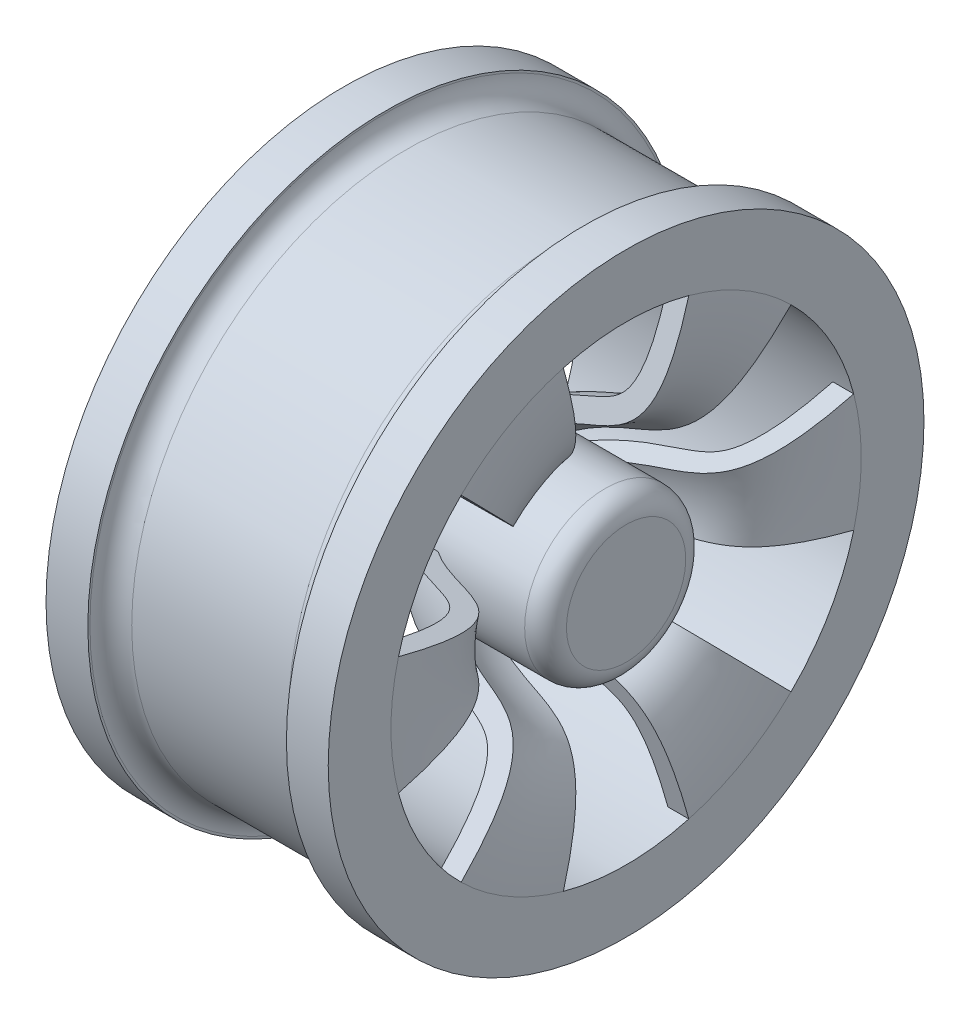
ISO-10303-21;
HEADER;
FILE_DESCRIPTION(('STEP AP214'),'2;1');
FILE_NAME('part.step','',(''),(''),'','','');
FILE_SCHEMA(('AUTOMOTIVE_DESIGN { 1 0 10303 214 1 1 1 1 }'));
ENDSEC;
DATA;
#1=APPLICATION_CONTEXT('core data for automotive mechanical design processes');
#2=APPLICATION_PROTOCOL_DEFINITION('international standard','automotive_design',2000,#1);
#3=PRODUCT_CONTEXT('',#1,'mechanical');
#4=PRODUCT('Part','Part','',(#3));
#5=PRODUCT_RELATED_PRODUCT_CATEGORY('part','',(#4));
#6=PRODUCT_DEFINITION_FORMATION('','',#4);
#7=PRODUCT_DEFINITION_CONTEXT('part definition',#1,'design');
#8=PRODUCT_DEFINITION('design','',#6,#7);
#9=PRODUCT_DEFINITION_SHAPE('','',#8);
#10=(LENGTH_UNIT() NAMED_UNIT(*) SI_UNIT(.MILLI.,.METRE.));
#11=(NAMED_UNIT(*) PLANE_ANGLE_UNIT() SI_UNIT($,.RADIAN.));
#12=(NAMED_UNIT(*) SI_UNIT($,.STERADIAN.) SOLID_ANGLE_UNIT());
#13=UNCERTAINTY_MEASURE_WITH_UNIT(LENGTH_MEASURE(1.E-05),#10,'distance_accuracy_value','');
#14=(GEOMETRIC_REPRESENTATION_CONTEXT(3) GLOBAL_UNCERTAINTY_ASSIGNED_CONTEXT((#13)) GLOBAL_UNIT_ASSIGNED_CONTEXT((#10,
#11,#12)) REPRESENTATION_CONTEXT('',''));
#15=CARTESIAN_POINT('',(0.,0.,0.));
#16=DIRECTION('',(0.,0.,1.));
#17=DIRECTION('',(1.,0.,0.));
#18=AXIS2_PLACEMENT_3D('',#15,#16,#17);
#19=CARTESIAN_POINT('',(-9.49999999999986,0.,0.));
#20=DIRECTION('',(-1.,0.,0.));
#21=DIRECTION('',(0.,0.,1.));
#22=AXIS2_PLACEMENT_3D('',#19,#20,#21);
#23=PLANE('',#22);
#24=DIRECTION('',(0.,0.,1.));
#25=VECTOR('',#24,1.);
#26=CARTESIAN_POINT('',(-9.49999999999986,-1.25,0.));
#27=LINE('',#26,#25);
#28=CARTESIAN_POINT('',(-9.49999999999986,-1.25,-2.));
#29=VERTEX_POINT('',#28);
#30=CARTESIAN_POINT('',(-9.49999999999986,-1.25,2.));
#31=VERTEX_POINT('',#30);
#32=EDGE_CURVE('E42',#29,#31,#27,.T.);
#33=ORIENTED_EDGE('',*,*,#32,.T.);
#34=CARTESIAN_POINT('',(-9.49999999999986,0.,1.36952398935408));
#35=DIRECTION('',(-1.,0.,0.));
#36=DIRECTION('',(0.,0.,1.));
#37=AXIS2_PLACEMENT_3D('',#34,#35,#36);
#38=CIRCLE('',#37,1.4);
#39=CARTESIAN_POINT('',(-9.49999999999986,1.25,2.));
#40=VERTEX_POINT('',#39);
#41=EDGE_CURVE('E11',#31,#40,#38,.T.);
#42=ORIENTED_EDGE('',*,*,#41,.T.);
#43=DIRECTION('',(0.,0.,-1.));
#44=VECTOR('',#43,1.);
#45=CARTESIAN_POINT('',(-9.49999999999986,1.25,0.));
#46=LINE('',#45,#44);
#47=CARTESIAN_POINT('',(-9.49999999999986,1.25,-2.));
#48=VERTEX_POINT('',#47);
#49=EDGE_CURVE('E251',#40,#48,#46,.T.);
#50=ORIENTED_EDGE('',*,*,#49,.T.);
#51=CARTESIAN_POINT('',(-9.49999999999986,0.,-1.36952398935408));
#52=DIRECTION('',(-1.,0.,0.));
#53=DIRECTION('',(0.,0.,1.));
#54=AXIS2_PLACEMENT_3D('',#51,#52,#53);
#55=CIRCLE('',#54,1.4);
#56=EDGE_CURVE('E225',#48,#29,#55,.T.);
#57=ORIENTED_EDGE('',*,*,#56,.T.);
#58=EDGE_LOOP('',(#33,#42,#50,#57));
#59=FACE_BOUND('',#58,.T.);
#60=CARTESIAN_POINT('',(-9.49999999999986,0.,0.));
#61=DIRECTION('',(-1.,0.,0.));
#62=DIRECTION('',(0.,0.,1.));
#63=AXIS2_PLACEMENT_3D('',#60,#61,#62);
#64=CIRCLE('',#63,4.5);
#65=CARTESIAN_POINT('',(-9.49999999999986,0.,4.5));
#66=VERTEX_POINT('',#65);
#67=EDGE_CURVE('E248',#66,#66,#64,.F.);
#68=ORIENTED_EDGE('',*,*,#67,.T.);
#69=EDGE_LOOP('',(#68));
#70=FACE_BOUND('',#69,.T.);
#71=ADVANCED_FACE('F34',(#59,#70),#23,.F.);
#72=CARTESIAN_POINT('',(11.4999999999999,0.,0.));
#73=DIRECTION('',(1.,0.,0.));
#74=DIRECTION('',(0.,0.,-1.));
#75=AXIS2_PLACEMENT_3D('',#72,#73,#74);
#76=PLANE('',#75);
#77=CARTESIAN_POINT('',(11.4999999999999,0.,0.));
#78=DIRECTION('',(1.,0.,0.));
#79=DIRECTION('',(0.,0.,-1.));
#80=AXIS2_PLACEMENT_3D('',#77,#78,#79);
#81=CIRCLE('',#80,4.5);
#82=CARTESIAN_POINT('',(11.4999999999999,0.,-4.5));
#83=VERTEX_POINT('',#82);
#84=EDGE_CURVE('E512',#83,#83,#81,.F.);
#85=ORIENTED_EDGE('',*,*,#84,.T.);
#86=EDGE_LOOP('',(#85));
#87=FACE_BOUND('',#86,.T.);
#88=ADVANCED_FACE('F593',(#87),#76,.F.);
#89=CARTESIAN_POINT('',(35.2913302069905,0.,0.));
#90=DIRECTION('',(-1.,0.,0.));
#91=DIRECTION('',(0.,0.,1.));
#92=AXIS2_PLACEMENT_3D('',#89,#90,#91);
#93=CYLINDRICAL_SURFACE('',#92,4.5);
#94=ORIENTED_EDGE('',*,*,#84,.F.);
#95=EDGE_LOOP('',(#94));
#96=FACE_BOUND('',#95,.T.);
#97=ORIENTED_EDGE('',*,*,#67,.F.);
#98=EDGE_LOOP('',(#97));
#99=FACE_BOUND('',#98,.T.);
#100=ADVANCED_FACE('F599',(#96,#99),#93,.F.);
#101=CARTESIAN_POINT('',(-8.49999999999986,0.,1.36952398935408));
#102=DIRECTION('',(-1.,0.,0.));
#103=DIRECTION('',(0.,0.,1.));
#104=AXIS2_PLACEMENT_3D('',#101,#102,#103);
#105=CYLINDRICAL_SURFACE('',#104,1.4);
#106=DIRECTION('',(-1.,0.,0.));
#107=VECTOR('',#106,1.);
#108=CARTESIAN_POINT('',(-8.49999999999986,-1.25,2.));
#109=LINE('',#108,#107);
#110=CARTESIAN_POINT('',(-13.4999999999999,-1.25,2.));
#111=VERTEX_POINT('',#110);
#112=EDGE_CURVE('E243',#31,#111,#109,.T.);
#113=ORIENTED_EDGE('',*,*,#112,.T.);
#114=CARTESIAN_POINT('',(-13.4999999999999,0.,1.36952398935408));
#115=DIRECTION('',(-1.,0.,0.));
#116=DIRECTION('',(0.,0.,-1.));
#117=AXIS2_PLACEMENT_3D('',#114,#115,#116);
#118=CIRCLE('',#117,1.4);
#119=CARTESIAN_POINT('',(-13.4999999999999,1.25,2.));
#120=VERTEX_POINT('',#119);
#121=EDGE_CURVE('E49',#111,#120,#118,.T.);
#122=ORIENTED_EDGE('',*,*,#121,.T.);
#123=DIRECTION('',(-1.,0.,0.));
#124=VECTOR('',#123,1.);
#125=CARTESIAN_POINT('',(-8.49999999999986,1.25,2.));
#126=LINE('',#125,#124);
#127=EDGE_CURVE('E228',#40,#120,#126,.T.);
#128=ORIENTED_EDGE('',*,*,#127,.F.);
#129=ORIENTED_EDGE('',*,*,#41,.F.);
#130=EDGE_LOOP('',(#113,#122,#128,#129));
#131=FACE_BOUND('',#130,.T.);
#132=ADVANCED_FACE('F606',(#131),#105,.F.);
#133=CARTESIAN_POINT('',(-8.49999999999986,-1.25,-2.));
#134=DIRECTION('',(0.,-1.,0.));
#135=DIRECTION('',(0.,0.,-1.));
#136=AXIS2_PLACEMENT_3D('',#133,#134,#135);
#137=PLANE('',#136);
#138=DIRECTION('',(-1.,0.,0.));
#139=VECTOR('',#138,1.);
#140=CARTESIAN_POINT('',(-8.49999999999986,-1.25,-2.));
#141=LINE('',#140,#139);
#142=CARTESIAN_POINT('',(-13.4999999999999,-1.25,-2.));
#143=VERTEX_POINT('',#142);
#144=EDGE_CURVE('E227',#29,#143,#141,.T.);
#145=ORIENTED_EDGE('',*,*,#144,.T.);
#146=DIRECTION('',(0.,0.,1.));
#147=VECTOR('',#146,1.);
#148=CARTESIAN_POINT('',(-13.4999999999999,-1.25,-2.));
#149=LINE('',#148,#147);
#150=EDGE_CURVE('E238',#143,#111,#149,.T.);
#151=ORIENTED_EDGE('',*,*,#150,.T.);
#152=ORIENTED_EDGE('',*,*,#112,.F.);
#153=ORIENTED_EDGE('',*,*,#32,.F.);
#154=EDGE_LOOP('',(#145,#151,#152,#153));
#155=FACE_BOUND('',#154,.T.);
#156=ADVANCED_FACE('F724',(#155),#137,.F.);
#157=CARTESIAN_POINT('',(-8.49999999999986,0.,-1.36952398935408));
#158=DIRECTION('',(-1.,0.,0.));
#159=DIRECTION('',(0.,0.,1.));
#160=AXIS2_PLACEMENT_3D('',#157,#158,#159);
#161=CYLINDRICAL_SURFACE('',#160,1.4);
#162=DIRECTION('',(-1.,0.,0.));
#163=VECTOR('',#162,1.);
#164=CARTESIAN_POINT('',(-8.49999999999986,1.25,-2.));
#165=LINE('',#164,#163);
#166=CARTESIAN_POINT('',(-13.4999999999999,1.25,-2.));
#167=VERTEX_POINT('',#166);
#168=EDGE_CURVE('E57',#48,#167,#165,.T.);
#169=ORIENTED_EDGE('',*,*,#168,.T.);
#170=CARTESIAN_POINT('',(-13.4999999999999,0.,-1.36952398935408));
#171=DIRECTION('',(-1.,0.,0.));
#172=DIRECTION('',(0.,0.,1.));
#173=AXIS2_PLACEMENT_3D('',#170,#171,#172);
#174=CIRCLE('',#173,1.4);
#175=EDGE_CURVE('E222',#167,#143,#174,.T.);
#176=ORIENTED_EDGE('',*,*,#175,.T.);
#177=ORIENTED_EDGE('',*,*,#144,.F.);
#178=ORIENTED_EDGE('',*,*,#56,.F.);
#179=EDGE_LOOP('',(#169,#176,#177,#178));
#180=FACE_BOUND('',#179,.T.);
#181=ADVANCED_FACE('F219',(#180),#161,.F.);
#182=CARTESIAN_POINT('',(-8.49999999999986,1.25,-2.));
#183=DIRECTION('',(0.,1.,0.));
#184=DIRECTION('',(0.,0.,1.));
#185=AXIS2_PLACEMENT_3D('',#182,#183,#184);
#186=PLANE('',#185);
#187=ORIENTED_EDGE('',*,*,#127,.T.);
#188=DIRECTION('',(0.,0.,-1.));
#189=VECTOR('',#188,1.);
#190=CARTESIAN_POINT('',(-13.4999999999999,1.25,-2.));
#191=LINE('',#190,#189);
#192=EDGE_CURVE('E231',#120,#167,#191,.T.);
#193=ORIENTED_EDGE('',*,*,#192,.T.);
#194=ORIENTED_EDGE('',*,*,#168,.F.);
#195=ORIENTED_EDGE('',*,*,#49,.F.);
#196=EDGE_LOOP('',(#187,#193,#194,#195));
#197=FACE_BOUND('',#196,.T.);
#198=ADVANCED_FACE('F232',(#197),#186,.F.);
#199=CARTESIAN_POINT('',(0.,4.5,0.));
#200=CARTESIAN_POINT('',(6.30254769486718,13.738832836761,0.));
#201=CARTESIAN_POINT('',(13.4999999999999,5.70585416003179,0.));
#202=CARTESIAN_POINT('',(13.4999999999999,22.5000000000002,0.));
#203=B_SPLINE_CURVE_WITH_KNOTS('',3,(#199,#200,#201,#202),.UNSPECIFIED.,.F.,.F.,(4,4),(0.,1.),.UNSPECIFIED.);
#204=CARTESIAN_POINT('',(0.,0.,0.));
#205=DIRECTION('',(-1.,0.,0.));
#206=AXIS1_PLACEMENT('',#204,#205);
#207=SURFACE_OF_REVOLUTION('',#203,#206);
#208=CARTESIAN_POINT('',(2.96040417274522,0.,0.));
#209=DIRECTION('',(-1.,0.,0.));
#210=DIRECTION('',(0.,0.,1.));
#211=AXIS2_PLACEMENT_3D('',#208,#209,#210);
#212=CIRCLE('',#211,7.70439868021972);
#213=CARTESIAN_POINT('',(2.96040417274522,-5.49196131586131,-5.40334340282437));
#214=VERTEX_POINT('',#213);
#215=CARTESIAN_POINT('',(2.96040417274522,-7.42541331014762,-2.05450631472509));
#216=VERTEX_POINT('',#215);
#217=EDGE_CURVE('E747',#214,#216,#212,.T.);
#218=ORIENTED_EDGE('',*,*,#217,.T.);
#219=CARTESIAN_POINT('',(0.,-4.33704968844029,-1.19999999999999));
#220=CARTESIAN_POINT('',(6.30254769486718,-13.2413334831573,-3.66368875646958));
#221=CARTESIAN_POINT('',(13.4999999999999,-5.49923844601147,-1.5215611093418));
#222=CARTESIAN_POINT('',(13.4999999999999,-21.6852484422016,-6.));
#223=B_SPLINE_CURVE_WITH_KNOTS('',3,(#219,#220,#221,#222),.UNSPECIFIED.,.F.,.F.,(4,4),(0.,1.),.UNSPECIFIED.);
#224=CARTESIAN_POINT('',(13.4999999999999,-21.6852484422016,-6.));
#225=VERTEX_POINT('',#224);
#226=EDGE_CURVE('E461',#216,#225,#223,.T.);
#227=ORIENTED_EDGE('',*,*,#226,.T.);
#228=CARTESIAN_POINT('',(13.4999999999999,0.,0.));
#229=DIRECTION('',(-1.,0.,0.));
#230=DIRECTION('',(0.,0.,1.));
#231=AXIS2_PLACEMENT_3D('',#228,#229,#230);
#232=CIRCLE('',#231,22.5000000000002);
#233=CARTESIAN_POINT('',(13.4999999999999,-16.0387766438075,-15.7799760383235));
#234=VERTEX_POINT('',#233);
#235=EDGE_CURVE('E807',#234,#225,#232,.T.);
#236=ORIENTED_EDGE('',*,*,#235,.F.);
#237=CARTESIAN_POINT('',(0.,-3.20775532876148,-3.15599520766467));
#238=CARTESIAN_POINT('',(6.30254769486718,-9.79351427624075,-9.63548679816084));
#239=CARTESIAN_POINT('',(13.4999999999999,-4.06732979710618,-4.00169964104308));
#240=CARTESIAN_POINT('',(13.4999999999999,-16.0387766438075,-15.7799760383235));
#241=B_SPLINE_CURVE_WITH_KNOTS('',3,(#237,#238,#239,#240),.UNSPECIFIED.,.F.,.F.,(4,4),(0.,1.),.UNSPECIFIED.);
#242=EDGE_CURVE('E413',#234,#214,#241,.F.);
#243=ORIENTED_EDGE('',*,*,#242,.T.);
#244=EDGE_LOOP('',(#218,#227,#236,#243));
#245=FACE_BOUND('',#244,.T.);
#246=ADVANCED_FACE('F554',(#245),#207,.T.);
#247=CARTESIAN_POINT('',(2.96040417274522,1.93345199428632,-7.45784971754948));
#248=VERTEX_POINT('',#247);
#249=CARTESIAN_POINT('',(2.96040417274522,-1.93345199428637,-7.45784971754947));
#250=VERTEX_POINT('',#249);
#251=EDGE_CURVE('E527',#248,#250,#212,.T.);
#252=ORIENTED_EDGE('',*,*,#251,.T.);
#253=CARTESIAN_POINT('',(0.,-1.12929435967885,-4.35599520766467));
#254=CARTESIAN_POINT('',(6.30254769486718,-3.44781920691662,-13.2991755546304));
#255=CARTESIAN_POINT('',(13.4999999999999,-1.43190864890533,-5.52326075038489));
#256=CARTESIAN_POINT('',(13.4999999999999,-5.64647179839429,-21.7799760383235));
#257=B_SPLINE_CURVE_WITH_KNOTS('',3,(#253,#254,#255,#256),.UNSPECIFIED.,.F.,.F.,(4,4),(0.,1.),.UNSPECIFIED.);
#258=CARTESIAN_POINT('',(13.4999999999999,-5.64647179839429,-21.7799760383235));
#259=VERTEX_POINT('',#258);
#260=EDGE_CURVE('E429',#250,#259,#257,.T.);
#261=ORIENTED_EDGE('',*,*,#260,.T.);
#262=CARTESIAN_POINT('',(13.4999999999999,5.64647179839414,-21.7799760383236));
#263=VERTEX_POINT('',#262);
#264=EDGE_CURVE('E804',#263,#259,#232,.T.);
#265=ORIENTED_EDGE('',*,*,#264,.F.);
#266=CARTESIAN_POINT('',(0.,1.12929435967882,-4.35599520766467));
#267=CARTESIAN_POINT('',(6.30254769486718,3.44781920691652,-13.2991755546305));
#268=CARTESIAN_POINT('',(13.4999999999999,1.43190864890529,-5.5232607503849));
#269=CARTESIAN_POINT('',(13.4999999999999,5.64647179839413,-21.7799760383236));
#270=B_SPLINE_CURVE_WITH_KNOTS('',3,(#266,#267,#268,#269),.UNSPECIFIED.,.F.,.F.,(4,4),(0.,1.),.UNSPECIFIED.);
#271=EDGE_CURVE('E317',#263,#248,#270,.F.);
#272=ORIENTED_EDGE('',*,*,#271,.T.);
#273=EDGE_LOOP('',(#252,#261,#265,#272));
#274=FACE_BOUND('',#273,.T.);
#275=ADVANCED_FACE('F738',(#274),#207,.T.);
#276=CARTESIAN_POINT('',(13.4999999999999,-21.6852484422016,6.));
#277=VERTEX_POINT('',#276);
#278=CARTESIAN_POINT('',(13.4999999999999,-16.0387766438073,15.7799760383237));
#279=VERTEX_POINT('',#278);
#280=EDGE_CURVE('E808',#277,#279,#232,.T.);
#281=ORIENTED_EDGE('',*,*,#280,.F.);
#282=CARTESIAN_POINT('',(0.,-4.33704968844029,1.19999999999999));
#283=CARTESIAN_POINT('',(6.30254769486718,-13.2413334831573,3.66368875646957));
#284=CARTESIAN_POINT('',(13.4999999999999,-5.49923844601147,1.5215611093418));
#285=CARTESIAN_POINT('',(13.4999999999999,-21.6852484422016,5.99999999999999));
#286=B_SPLINE_CURVE_WITH_KNOTS('',3,(#282,#283,#284,#285),.UNSPECIFIED.,.F.,.F.,(4,4),(0.,1.),.UNSPECIFIED.);
#287=CARTESIAN_POINT('',(2.96040417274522,-7.42541331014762,2.05450631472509));
#288=VERTEX_POINT('',#287);
#289=EDGE_CURVE('E445',#277,#288,#286,.F.);
#290=ORIENTED_EDGE('',*,*,#289,.T.);
#291=CARTESIAN_POINT('',(2.96040417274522,-5.49196131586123,5.40334340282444));
#292=VERTEX_POINT('',#291);
#293=EDGE_CURVE('E753',#288,#292,#212,.T.);
#294=ORIENTED_EDGE('',*,*,#293,.T.);
#295=CARTESIAN_POINT('',(0.,-3.20775532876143,3.15599520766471));
#296=CARTESIAN_POINT('',(6.30254769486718,-9.79351427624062,9.63548679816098));
#297=CARTESIAN_POINT('',(13.4999999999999,-4.06732979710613,4.00169964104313));
#298=CARTESIAN_POINT('',(13.4999999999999,-16.0387766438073,15.7799760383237));
#299=B_SPLINE_CURVE_WITH_KNOTS('',3,(#295,#296,#297,#298),.UNSPECIFIED.,.F.,.F.,(4,4),(0.,1.),.UNSPECIFIED.);
#300=EDGE_CURVE('E397',#292,#279,#299,.T.);
#301=ORIENTED_EDGE('',*,*,#300,.T.);
#302=EDGE_LOOP('',(#281,#290,#294,#301));
#303=FACE_BOUND('',#302,.T.);
#304=ADVANCED_FACE('F743',(#303),#207,.T.);
#305=CARTESIAN_POINT('',(13.4999999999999,-5.64647179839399,21.7799760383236));
#306=VERTEX_POINT('',#305);
#307=CARTESIAN_POINT('',(13.4999999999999,5.64647179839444,21.7799760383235));
#308=VERTEX_POINT('',#307);
#309=EDGE_CURVE('E811',#306,#308,#232,.T.);
#310=ORIENTED_EDGE('',*,*,#309,.F.);
#311=CARTESIAN_POINT('',(0.,-1.12929435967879,4.35599520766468));
#312=CARTESIAN_POINT('',(6.30254769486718,-3.44781920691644,13.2991755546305));
#313=CARTESIAN_POINT('',(13.4999999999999,-1.43190864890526,5.5232607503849));
#314=CARTESIAN_POINT('',(13.4999999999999,-5.64647179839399,21.7799760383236));
#315=B_SPLINE_CURVE_WITH_KNOTS('',3,(#311,#312,#313,#314),.UNSPECIFIED.,.F.,.F.,(4,4),(0.,1.),.UNSPECIFIED.);
#316=CARTESIAN_POINT('',(2.96040417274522,-1.93345199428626,7.4578497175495));
#317=VERTEX_POINT('',#316);
#318=EDGE_CURVE('E381',#306,#317,#315,.F.);
#319=ORIENTED_EDGE('',*,*,#318,.T.);
#320=CARTESIAN_POINT('',(2.96040417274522,1.93345199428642,7.45784971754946));
#321=VERTEX_POINT('',#320);
#322=EDGE_CURVE('E756',#317,#321,#212,.T.);
#323=ORIENTED_EDGE('',*,*,#322,.T.);
#324=CARTESIAN_POINT('',(0.,1.12929435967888,4.35599520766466));
#325=CARTESIAN_POINT('',(6.30254769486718,3.4478192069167,13.2991755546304));
#326=CARTESIAN_POINT('',(13.4999999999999,1.43190864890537,5.52326075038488));
#327=CARTESIAN_POINT('',(13.4999999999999,5.64647179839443,21.7799760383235));
#328=B_SPLINE_CURVE_WITH_KNOTS('',3,(#324,#325,#326,#327),.UNSPECIFIED.,.F.,.F.,(4,4),(0.,1.),.UNSPECIFIED.);
#329=EDGE_CURVE('E365',#321,#308,#328,.T.);
#330=ORIENTED_EDGE('',*,*,#329,.T.);
#331=EDGE_LOOP('',(#310,#319,#323,#330));
#332=FACE_BOUND('',#331,.T.);
#333=ADVANCED_FACE('F821',(#332),#207,.T.);
#334=CARTESIAN_POINT('',(2.96040417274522,7.42541331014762,-2.05450631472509));
#335=VERTEX_POINT('',#334);
#336=CARTESIAN_POINT('',(2.96040417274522,5.49196131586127,-5.4033434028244));
#337=VERTEX_POINT('',#336);
#338=EDGE_CURVE('E523',#335,#337,#212,.T.);
#339=ORIENTED_EDGE('',*,*,#338,.T.);
#340=CARTESIAN_POINT('',(0.,3.20775532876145,-3.15599520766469));
#341=CARTESIAN_POINT('',(6.30254769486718,9.79351427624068,-9.63548679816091));
#342=CARTESIAN_POINT('',(13.4999999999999,4.06732979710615,-4.0016996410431));
#343=CARTESIAN_POINT('',(13.4999999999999,16.0387766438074,-15.7799760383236));
#344=B_SPLINE_CURVE_WITH_KNOTS('',3,(#340,#341,#342,#343),.UNSPECIFIED.,.F.,.F.,(4,4),(0.,1.),.UNSPECIFIED.);
#345=CARTESIAN_POINT('',(13.4999999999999,16.0387766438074,-15.7799760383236));
#346=VERTEX_POINT('',#345);
#347=EDGE_CURVE('E333',#337,#346,#344,.T.);
#348=ORIENTED_EDGE('',*,*,#347,.T.);
#349=CARTESIAN_POINT('',(13.4999999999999,21.6852484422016,-6.));
#350=VERTEX_POINT('',#349);
#351=EDGE_CURVE('E697',#350,#346,#232,.T.);
#352=ORIENTED_EDGE('',*,*,#351,.F.);
#353=CARTESIAN_POINT('',(0.,4.33704968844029,-1.19999999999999));
#354=CARTESIAN_POINT('',(6.30254769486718,13.2413334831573,-3.66368875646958));
#355=CARTESIAN_POINT('',(13.4999999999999,5.49923844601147,-1.5215611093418));
#356=CARTESIAN_POINT('',(13.4999999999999,21.6852484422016,-6.));
#357=B_SPLINE_CURVE_WITH_KNOTS('',3,(#353,#354,#355,#356),.UNSPECIFIED.,.F.,.F.,(4,4),(0.,1.),.UNSPECIFIED.);
#358=EDGE_CURVE('E487',#350,#335,#357,.F.);
#359=ORIENTED_EDGE('',*,*,#358,.T.);
#360=EDGE_LOOP('',(#339,#348,#352,#359));
#361=FACE_BOUND('',#360,.T.);
#362=ADVANCED_FACE('F555',(#361),#207,.T.);
#363=CARTESIAN_POINT('',(11.4999999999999,22.5000000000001,0.));
#364=CARTESIAN_POINT('',(11.4999976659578,22.2528656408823,0.));
#365=CARTESIAN_POINT('',(11.4965975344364,21.7494814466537,0.));
#366=CARTESIAN_POINT('',(11.4765829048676,20.8157746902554,0.));
#367=CARTESIAN_POINT('',(11.4275058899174,19.7327536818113,0.));
#368=CARTESIAN_POINT('',(11.3326895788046,18.5775650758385,0.));
#369=CARTESIAN_POINT('',(11.1624943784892,17.2161590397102,0.));
#370=CARTESIAN_POINT('',(10.876349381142,15.8374408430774,0.));
#371=CARTESIAN_POINT('',(10.4529175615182,14.6451095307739,0.));
#372=CARTESIAN_POINT('',(9.99378194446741,13.8353673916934,0.));
#373=CARTESIAN_POINT('',(9.51603963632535,13.2821970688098,0.));
#374=CARTESIAN_POINT('',(8.96857815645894,12.8511293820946,0.));
#375=CARTESIAN_POINT('',(8.0451881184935,12.3369513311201,0.));
#376=CARTESIAN_POINT('',(6.43472303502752,11.7429893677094,0.));
#377=CARTESIAN_POINT('',(4.32120647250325,10.924826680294,0.));
#378=CARTESIAN_POINT('',(2.47989707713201,9.86012400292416,0.));
#379=CARTESIAN_POINT('',(1.07308091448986,8.79783639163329,0.));
#380=CARTESIAN_POINT('',(-0.0881894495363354,7.64793419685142,0.));
#381=CARTESIAN_POINT('',(-0.987428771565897,6.56149289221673,0.));
#382=CARTESIAN_POINT('',(-1.44004255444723,5.93839569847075,0.));
#383=CARTESIAN_POINT('',(-1.65232432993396,5.62722057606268,0.));
#384=B_SPLINE_CURVE_WITH_KNOTS('',3,(#363,#364,#365,#366,#367,#368,#369,#370,#371,#372,#373,
#374,#375,#376,#377,#378,#379,#380,#381,#382,#383),.UNSPECIFIED.,.F.,.F.,(4,1,1,1,1,1,1,1,1,1,1,
1,1,1,1,1,1,1,4),(0.,0.015625,0.03125,0.0625,0.09375,0.125,0.1875,0.25,0.3125,0.375,0.4375,0.5,
0.625,0.75,0.8125,0.875,0.9375,0.96875,1.),.UNSPECIFIED.);
#385=CARTESIAN_POINT('',(0.,0.,0.));
#386=DIRECTION('',(-1.,0.,0.));
#387=AXIS1_PLACEMENT('',#385,#386);
#388=SURFACE_OF_REVOLUTION('',#384,#387);
#389=CARTESIAN_POINT('',(11.4999999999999,0.,0.));
#390=DIRECTION('',(-1.,0.,0.));
#391=DIRECTION('',(0.,0.,1.));
#392=AXIS2_PLACEMENT_3D('',#389,#390,#391);
#393=CIRCLE('',#392,22.5000000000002);
#394=CARTESIAN_POINT('',(11.4999999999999,-16.0387766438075,-15.7799760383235));
#395=VERTEX_POINT('',#394);
#396=CARTESIAN_POINT('',(11.4999999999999,-21.6852484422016,-6.));
#397=VERTEX_POINT('',#396);
#398=EDGE_CURVE('E827',#395,#397,#393,.T.);
#399=ORIENTED_EDGE('',*,*,#398,.T.);
#400=CARTESIAN_POINT('',(11.4999999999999,-21.6852484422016,-5.99999999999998));
#401=CARTESIAN_POINT('',(11.4999976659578,-21.4470631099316,-5.93409750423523));
#402=CARTESIAN_POINT('',(11.4965975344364,-20.9619070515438,-5.79986171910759));
#403=CARTESIAN_POINT('',(11.4765829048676,-20.0620109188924,-5.55087325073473));
#404=CARTESIAN_POINT('',(11.4275058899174,-19.0182073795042,-5.26206764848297));
#405=CARTESIAN_POINT('',(11.3326895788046,-17.9048495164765,-4.95401735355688));
#406=CARTESIAN_POINT('',(11.1624943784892,-16.5927415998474,-4.59097574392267));
#407=CARTESIAN_POINT('',(10.876349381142,-15.2639484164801,-4.22331755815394));
#408=CARTESIAN_POINT('',(10.4529175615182,-14.1147928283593,-3.90536254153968));
#409=CARTESIAN_POINT('',(9.99378194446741,-13.3343724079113,-3.68943130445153));
#410=CARTESIAN_POINT('',(9.51603963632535,-12.801233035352,-3.54191921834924));
#411=CARTESIAN_POINT('',(8.96857815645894,-12.3857748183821,-3.4269678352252));
#412=CARTESIAN_POINT('',(8.0451881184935,-11.8902157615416,-3.28985368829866));
#413=CARTESIAN_POINT('',(6.43472303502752,-11.3177618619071,-3.13146383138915));
#414=CARTESIAN_POINT('',(4.32120647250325,-10.5292258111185,-2.91328711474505));
#415=CARTESIAN_POINT('',(2.47989707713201,-9.50307727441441,-2.62936640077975));
#416=CARTESIAN_POINT('',(1.07308091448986,-8.47925635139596,-2.34608970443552));
#417=CARTESIAN_POINT('',(-0.0881894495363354,-7.37099347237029,-2.03944911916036));
#418=CARTESIAN_POINT('',(-0.987428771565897,-6.32389348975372,-1.74973143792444));
#419=CARTESIAN_POINT('',(-1.44004255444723,-5.72335938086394,-1.58357218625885));
#420=CARTESIAN_POINT('',(-1.65232432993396,-5.42345227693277,-1.5005921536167));
#421=B_SPLINE_CURVE_WITH_KNOTS('',3,(#400,#401,#402,#403,#404,#405,#406,#407,#408,#409,#410,
#411,#412,#413,#414,#415,#416,#417,#418,#419,#420),.UNSPECIFIED.,.F.,.F.,(4,1,1,1,1,1,1,1,1,1,1,
1,1,1,1,1,1,1,4),(0.,0.015625,0.03125,0.0625,0.09375,0.125,0.1875,0.25,0.3125,0.375,0.4375,0.5,
0.625,0.75,0.8125,0.875,0.9375,0.96875,1.),.UNSPECIFIED.);
#422=CARTESIAN_POINT('',(0.,-7.42541331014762,-2.05450631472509));
#423=VERTEX_POINT('',#422);
#424=EDGE_CURVE('E453',#397,#423,#421,.T.);
#425=ORIENTED_EDGE('',*,*,#424,.T.);
#426=CARTESIAN_POINT('',(0.,0.,0.));
#427=DIRECTION('',(-1.,0.,0.));
#428=DIRECTION('',(0.,0.,1.));
#429=AXIS2_PLACEMENT_3D('',#426,#427,#428);
#430=CIRCLE('',#429,7.70439868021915);
#431=CARTESIAN_POINT('',(0.,-5.49196131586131,-5.40334340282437));
#432=VERTEX_POINT('',#431);
#433=EDGE_CURVE('E781',#432,#423,#430,.T.);
#434=ORIENTED_EDGE('',*,*,#433,.F.);
#435=CARTESIAN_POINT('',(11.4999999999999,-16.0387766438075,-15.7799760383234));
#436=CARTESIAN_POINT('',(11.4999976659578,-15.8626107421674,-15.6066527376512));
#437=CARTESIAN_POINT('',(11.4965975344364,-15.503781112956,-15.2536131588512));
#438=CARTESIAN_POINT('',(11.4765829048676,-14.83820270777,-14.5987744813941));
#439=CARTESIAN_POINT('',(11.4275058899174,-14.0661879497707,-13.8392169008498));
#440=CARTESIAN_POINT('',(11.3326895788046,-13.2427296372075,-13.0290458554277));
#441=CARTESIAN_POINT('',(11.1624943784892,-12.272272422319,-12.0742478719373));
#442=CARTESIAN_POINT('',(10.876349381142,-11.2894745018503,-11.10730831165));
#443=CARTESIAN_POINT('',(10.4529175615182,-10.4395395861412,-10.2710878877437));
#444=CARTESIAN_POINT('',(9.99378194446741,-9.86232743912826,-9.70318959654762));
#445=CARTESIAN_POINT('',(9.51603963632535,-9.46800853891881,-9.31523339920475));
#446=CARTESIAN_POINT('',(8.96857815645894,-9.16072861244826,-9.01291172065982));
#447=CARTESIAN_POINT('',(8.0451881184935,-8.79420474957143,-8.65230206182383));
#448=CARTESIAN_POINT('',(6.43472303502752,-8.37080815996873,-8.23573737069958));
#449=CARTESIAN_POINT('',(4.32120647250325,-7.78759355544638,-7.6619334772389));
#450=CARTESIAN_POINT('',(2.47989707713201,-7.02863673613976,-6.91522313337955));
#451=CARTESIAN_POINT('',(1.07308091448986,-6.2714014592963,-6.17020655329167));
#452=CARTESIAN_POINT('',(-0.0881894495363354,-5.45171148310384,-5.36374303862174));
#453=CARTESIAN_POINT('',(-0.987428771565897,-4.67725861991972,-4.6017866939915));
#454=CARTESIAN_POINT('',(-1.44004255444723,-4.23309343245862,-4.16478852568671));
#455=CARTESIAN_POINT('',(-1.65232432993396,-4.01127706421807,-3.94655137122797));
#456=B_SPLINE_CURVE_WITH_KNOTS('',3,(#435,#436,#437,#438,#439,#440,#441,#442,#443,#444,#445,
#446,#447,#448,#449,#450,#451,#452,#453,#454,#455),.UNSPECIFIED.,.F.,.F.,(4,1,1,1,1,1,1,1,1,1,1,
1,1,1,1,1,1,1,4),(0.,0.015625,0.03125,0.0625,0.09375,0.125,0.1875,0.25,0.3125,0.375,0.4375,0.5,
0.625,0.75,0.8125,0.875,0.9375,0.96875,1.),.UNSPECIFIED.);
#457=EDGE_CURVE('E405',#432,#395,#456,.F.);
#458=ORIENTED_EDGE('',*,*,#457,.T.);
#459=EDGE_LOOP('',(#399,#425,#434,#458));
#460=FACE_BOUND('',#459,.T.);
#461=ADVANCED_FACE('F547',(#460),#388,.T.);
#462=CARTESIAN_POINT('',(11.4999999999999,5.64647179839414,-21.7799760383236));
#463=VERTEX_POINT('',#462);
#464=CARTESIAN_POINT('',(11.4999999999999,-5.64647179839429,-21.7799760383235));
#465=VERTEX_POINT('',#464);
#466=EDGE_CURVE('E687',#463,#465,#393,.T.);
#467=ORIENTED_EDGE('',*,*,#466,.T.);
#468=CARTESIAN_POINT('',(11.4999999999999,-5.64647179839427,-21.7799760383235));
#469=CARTESIAN_POINT('',(11.4999976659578,-5.58445236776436,-21.5407502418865));
#470=CARTESIAN_POINT('',(11.4965975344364,-5.45812593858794,-21.0534748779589));
#471=CARTESIAN_POINT('',(11.4765829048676,-5.22380821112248,-20.1496477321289));
#472=CARTESIAN_POINT('',(11.4275058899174,-4.95201942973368,-19.1012845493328));
#473=CARTESIAN_POINT('',(11.3326895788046,-4.66211987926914,-17.9830632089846));
#474=CARTESIAN_POINT('',(11.1624943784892,-4.3204691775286,-16.66522361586));
#475=CARTESIAN_POINT('',(10.876349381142,-3.97447391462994,-15.330625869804));
#476=CARTESIAN_POINT('',(10.4529175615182,-3.6752532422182,-14.1764504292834));
#477=CARTESIAN_POINT('',(9.99378194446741,-3.47204496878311,-13.3926209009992));
#478=CARTESIAN_POINT('',(9.51603963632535,-3.33322449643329,-12.857152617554));
#479=CARTESIAN_POINT('',(8.96857815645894,-3.2250462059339,-12.439879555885));
#480=CARTESIAN_POINT('',(8.0451881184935,-3.0960110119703,-11.9421557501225));
#481=CARTESIAN_POINT('',(6.43472303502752,-2.94695370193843,-11.3672012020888));
#482=CARTESIAN_POINT('',(4.32120647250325,-2.74163225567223,-10.575220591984));
#483=CARTESIAN_POINT('',(2.47989707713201,-2.47444053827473,-9.54458953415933));
#484=CARTESIAN_POINT('',(1.07308091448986,-2.20785489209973,-8.51629625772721));
#485=CARTESIAN_POINT('',(-0.0881894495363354,-1.91928198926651,-7.40319215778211));
#486=CARTESIAN_POINT('',(-0.987428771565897,-1.64663486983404,-6.35151813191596));
#487=CARTESIAN_POINT('',(-1.44004255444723,-1.49026594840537,-5.74836071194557));
#488=CARTESIAN_POINT('',(-1.65232432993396,-1.41217521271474,-5.44714352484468));
#489=B_SPLINE_CURVE_WITH_KNOTS('',3,(#468,#469,#470,#471,#472,#473,#474,#475,#476,#477,#478,
#479,#480,#481,#482,#483,#484,#485,#486,#487,#488),.UNSPECIFIED.,.F.,.F.,(4,1,1,1,1,1,1,1,1,1,1,
1,1,1,1,1,1,1,4),(0.,0.015625,0.03125,0.0625,0.09375,0.125,0.1875,0.25,0.3125,0.375,0.4375,0.5,
0.625,0.75,0.8125,0.875,0.9375,0.96875,1.),.UNSPECIFIED.);
#490=CARTESIAN_POINT('',(0.,-1.93345199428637,-7.45784971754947));
#491=VERTEX_POINT('',#490);
#492=EDGE_CURVE('E421',#465,#491,#489,.T.);
#493=ORIENTED_EDGE('',*,*,#492,.T.);
#494=CARTESIAN_POINT('',(0.,1.93345199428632,-7.45784971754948));
#495=VERTEX_POINT('',#494);
#496=EDGE_CURVE('E692',#495,#491,#430,.T.);
#497=ORIENTED_EDGE('',*,*,#496,.F.);
#498=CARTESIAN_POINT('',(11.4999999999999,5.64647179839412,-21.7799760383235));
#499=CARTESIAN_POINT('',(11.4999976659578,5.58445236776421,-21.5407502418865));
#500=CARTESIAN_POINT('',(11.4965975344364,5.45812593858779,-21.0534748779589));
#501=CARTESIAN_POINT('',(11.4765829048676,5.22380821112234,-20.1496477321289));
#502=CARTESIAN_POINT('',(11.4275058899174,4.95201942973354,-19.1012845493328));
#503=CARTESIAN_POINT('',(11.3326895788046,4.66211987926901,-17.9830632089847));
#504=CARTESIAN_POINT('',(11.1624943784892,4.32046917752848,-16.6652236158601));
#505=CARTESIAN_POINT('',(10.876349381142,3.97447391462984,-15.330625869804));
#506=CARTESIAN_POINT('',(10.4529175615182,3.6752532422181,-14.1764504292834));
#507=CARTESIAN_POINT('',(9.99378194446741,3.47204496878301,-13.3926209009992));
#508=CARTESIAN_POINT('',(9.51603963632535,3.3332244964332,-12.857152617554));
#509=CARTESIAN_POINT('',(8.96857815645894,3.22504620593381,-12.4398795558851));
#510=CARTESIAN_POINT('',(8.0451881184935,3.09601101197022,-11.9421557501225));
#511=CARTESIAN_POINT('',(6.43472303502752,2.94695370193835,-11.3672012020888));
#512=CARTESIAN_POINT('',(4.32120647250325,2.74163225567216,-10.575220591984));
#513=CARTESIAN_POINT('',(2.47989707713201,2.47444053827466,-9.54458953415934));
#514=CARTESIAN_POINT('',(1.07308091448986,2.20785489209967,-8.51629625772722));
#515=CARTESIAN_POINT('',(-0.0881894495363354,1.91928198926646,-7.40319215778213));
#516=CARTESIAN_POINT('',(-0.987428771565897,1.646634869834,-6.35151813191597));
#517=CARTESIAN_POINT('',(-1.44004255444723,1.49026594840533,-5.74836071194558));
#518=CARTESIAN_POINT('',(-1.65232432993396,1.41217521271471,-5.44714352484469));
#519=B_SPLINE_CURVE_WITH_KNOTS('',3,(#498,#499,#500,#501,#502,#503,#504,#505,#506,#507,#508,
#509,#510,#511,#512,#513,#514,#515,#516,#517,#518),.UNSPECIFIED.,.F.,.F.,(4,1,1,1,1,1,1,1,1,1,1,
1,1,1,1,1,1,1,4),(0.,0.015625,0.03125,0.0625,0.09375,0.125,0.1875,0.25,0.3125,0.375,0.4375,0.5,
0.625,0.75,0.8125,0.875,0.9375,0.96875,1.),.UNSPECIFIED.);
#520=EDGE_CURVE('E307',#495,#463,#519,.F.);
#521=ORIENTED_EDGE('',*,*,#520,.T.);
#522=EDGE_LOOP('',(#467,#493,#497,#521));
#523=FACE_BOUND('',#522,.T.);
#524=ADVANCED_FACE('F794',(#523),#388,.T.);
#525=CARTESIAN_POINT('',(0.,-7.42541331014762,2.05450631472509));
#526=VERTEX_POINT('',#525);
#527=CARTESIAN_POINT('',(0.,-5.49196131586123,5.40334340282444));
#528=VERTEX_POINT('',#527);
#529=EDGE_CURVE('E776',#526,#528,#430,.T.);
#530=ORIENTED_EDGE('',*,*,#529,.F.);
#531=CARTESIAN_POINT('',(11.4999999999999,-21.6852484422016,5.99999999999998));
#532=CARTESIAN_POINT('',(11.4999976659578,-21.4470631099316,5.93409750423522));
#533=CARTESIAN_POINT('',(11.4965975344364,-20.9619070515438,5.79986171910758));
#534=CARTESIAN_POINT('',(11.4765829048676,-20.0620109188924,5.55087325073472));
#535=CARTESIAN_POINT('',(11.4275058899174,-19.0182073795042,5.26206764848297));
#536=CARTESIAN_POINT('',(11.3326895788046,-17.9048495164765,4.95401735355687));
#537=CARTESIAN_POINT('',(11.1624943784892,-16.5927415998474,4.59097574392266));
#538=CARTESIAN_POINT('',(10.876349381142,-15.2639484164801,4.22331755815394));
#539=CARTESIAN_POINT('',(10.4529175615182,-14.1147928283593,3.90536254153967));
#540=CARTESIAN_POINT('',(9.99378194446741,-13.3343724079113,3.68943130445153));
#541=CARTESIAN_POINT('',(9.51603963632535,-12.801233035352,3.54191921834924));
#542=CARTESIAN_POINT('',(8.96857815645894,-12.3857748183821,3.4269678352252));
#543=CARTESIAN_POINT('',(8.0451881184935,-11.8902157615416,3.28985368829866));
#544=CARTESIAN_POINT('',(6.43472303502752,-11.3177618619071,3.13146383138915));
#545=CARTESIAN_POINT('',(4.32120647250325,-10.5292258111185,2.91328711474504));
#546=CARTESIAN_POINT('',(2.47989707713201,-9.50307727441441,2.62936640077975));
#547=CARTESIAN_POINT('',(1.07308091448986,-8.47925635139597,2.34608970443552));
#548=CARTESIAN_POINT('',(-0.0881894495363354,-7.37099347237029,2.03944911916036));
#549=CARTESIAN_POINT('',(-0.987428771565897,-6.32389348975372,1.74973143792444));
#550=CARTESIAN_POINT('',(-1.44004255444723,-5.72335938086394,1.58357218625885));
#551=CARTESIAN_POINT('',(-1.65232432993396,-5.42345227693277,1.5005921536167));
#552=B_SPLINE_CURVE_WITH_KNOTS('',3,(#531,#532,#533,#534,#535,#536,#537,#538,#539,#540,#541,
#542,#543,#544,#545,#546,#547,#548,#549,#550,#551),.UNSPECIFIED.,.F.,.F.,(4,1,1,1,1,1,1,1,1,1,1,
1,1,1,1,1,1,1,4),(0.,0.015625,0.03125,0.0625,0.09375,0.125,0.1875,0.25,0.3125,0.375,0.4375,0.5,
0.625,0.75,0.8125,0.875,0.9375,0.96875,1.),.UNSPECIFIED.);
#553=CARTESIAN_POINT('',(11.4999999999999,-21.6852484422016,6.));
#554=VERTEX_POINT('',#553);
#555=EDGE_CURVE('E437',#526,#554,#552,.F.);
#556=ORIENTED_EDGE('',*,*,#555,.T.);
#557=CARTESIAN_POINT('',(11.4999999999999,-16.0387766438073,15.7799760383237));
#558=VERTEX_POINT('',#557);
#559=EDGE_CURVE('E825',#554,#558,#393,.T.);
#560=ORIENTED_EDGE('',*,*,#559,.T.);
#561=CARTESIAN_POINT('',(11.4999999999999,-16.0387766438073,15.7799760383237));
#562=CARTESIAN_POINT('',(11.4999976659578,-15.8626107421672,15.6066527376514));
#563=CARTESIAN_POINT('',(11.4965975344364,-15.5037811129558,15.2536131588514));
#564=CARTESIAN_POINT('',(11.4765829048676,-14.8382027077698,14.5987744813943));
#565=CARTESIAN_POINT('',(11.4275058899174,-14.0661879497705,13.8392169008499));
#566=CARTESIAN_POINT('',(11.3326895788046,-13.2427296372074,13.0290458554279));
#567=CARTESIAN_POINT('',(11.1624943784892,-12.2722724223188,12.0742478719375));
#568=CARTESIAN_POINT('',(10.876349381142,-11.2894745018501,11.1073083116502));
#569=CARTESIAN_POINT('',(10.4529175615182,-10.4395395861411,10.2710878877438));
#570=CARTESIAN_POINT('',(9.99378194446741,-9.86232743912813,9.70318959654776));
#571=CARTESIAN_POINT('',(9.51603963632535,-9.46800853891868,9.31523339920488));
#572=CARTESIAN_POINT('',(8.96857815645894,-9.16072861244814,9.01291172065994));
#573=CARTESIAN_POINT('',(8.0451881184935,-8.79420474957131,8.65230206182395));
#574=CARTESIAN_POINT('',(6.43472303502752,-8.37080815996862,8.23573737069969));
#575=CARTESIAN_POINT('',(4.32120647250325,-7.78759355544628,7.66193347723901));
#576=CARTESIAN_POINT('',(2.47989707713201,-7.02863673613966,6.91522313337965));
#577=CARTESIAN_POINT('',(1.07308091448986,-6.27140145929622,6.17020655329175));
#578=CARTESIAN_POINT('',(-0.0881894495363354,-5.45171148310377,5.36374303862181));
#579=CARTESIAN_POINT('',(-0.987428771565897,-4.67725861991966,4.60178669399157));
#580=CARTESIAN_POINT('',(-1.44004255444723,-4.23309343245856,4.16478852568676));
#581=CARTESIAN_POINT('',(-1.65232432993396,-4.01127706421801,3.94655137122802));
#582=B_SPLINE_CURVE_WITH_KNOTS('',3,(#561,#562,#563,#564,#565,#566,#567,#568,#569,#570,#571,
#572,#573,#574,#575,#576,#577,#578,#579,#580,#581),.UNSPECIFIED.,.F.,.F.,(4,1,1,1,1,1,1,1,1,1,1,
1,1,1,1,1,1,1,4),(0.,0.015625,0.03125,0.0625,0.09375,0.125,0.1875,0.25,0.3125,0.375,0.4375,0.5,
0.625,0.75,0.8125,0.875,0.9375,0.96875,1.),.UNSPECIFIED.);
#583=EDGE_CURVE('E389',#558,#528,#582,.T.);
#584=ORIENTED_EDGE('',*,*,#583,.T.);
#585=EDGE_LOOP('',(#530,#556,#560,#584));
#586=FACE_BOUND('',#585,.T.);
#587=ADVANCED_FACE('F853',(#586),#388,.T.);
#588=CARTESIAN_POINT('',(0.,-1.93345199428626,7.4578497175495));
#589=VERTEX_POINT('',#588);
#590=CARTESIAN_POINT('',(0.,1.93345199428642,7.45784971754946));
#591=VERTEX_POINT('',#590);
#592=EDGE_CURVE('E774',#589,#591,#430,.T.);
#593=ORIENTED_EDGE('',*,*,#592,.F.);
#594=CARTESIAN_POINT('',(11.4999999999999,-5.64647179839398,21.7799760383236));
#595=CARTESIAN_POINT('',(11.4999976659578,-5.58445236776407,21.5407502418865));
#596=CARTESIAN_POINT('',(11.4965975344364,-5.45812593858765,21.0534748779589));
#597=CARTESIAN_POINT('',(11.4765829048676,-5.22380821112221,20.149647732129));
#598=CARTESIAN_POINT('',(11.4275058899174,-4.95201942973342,19.1012845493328));
#599=CARTESIAN_POINT('',(11.3326895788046,-4.66211987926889,17.9830632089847));
#600=CARTESIAN_POINT('',(11.1624943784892,-4.32046917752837,16.6652236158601));
#601=CARTESIAN_POINT('',(10.876349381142,-3.97447391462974,15.330625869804));
#602=CARTESIAN_POINT('',(10.4529175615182,-3.67525324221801,14.1764504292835));
#603=CARTESIAN_POINT('',(9.99378194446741,-3.47204496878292,13.3926209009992));
#604=CARTESIAN_POINT('',(9.51603963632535,-3.33322449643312,12.8571526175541));
#605=CARTESIAN_POINT('',(8.96857815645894,-3.22504620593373,12.4398795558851));
#606=CARTESIAN_POINT('',(8.0451881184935,-3.09601101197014,11.9421557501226));
#607=CARTESIAN_POINT('',(6.43472303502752,-2.94695370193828,11.3672012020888));
#608=CARTESIAN_POINT('',(4.32120647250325,-2.74163225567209,10.575220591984));
#609=CARTESIAN_POINT('',(2.47989707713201,-2.4744405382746,9.54458953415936));
#610=CARTESIAN_POINT('',(1.07308091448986,-2.20785489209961,8.51629625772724));
#611=CARTESIAN_POINT('',(-0.0881894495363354,-1.91928198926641,7.40319215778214));
#612=CARTESIAN_POINT('',(-0.987428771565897,-1.64663486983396,6.35151813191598));
#613=CARTESIAN_POINT('',(-1.44004255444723,-1.49026594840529,5.74836071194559));
#614=CARTESIAN_POINT('',(-1.65232432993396,-1.41217521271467,5.4471435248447));
#615=B_SPLINE_CURVE_WITH_KNOTS('',3,(#594,#595,#596,#597,#598,#599,#600,#601,#602,#603,#604,
#605,#606,#607,#608,#609,#610,#611,#612,#613,#614),.UNSPECIFIED.,.F.,.F.,(4,1,1,1,1,1,1,1,1,1,1,
1,1,1,1,1,1,1,4),(0.,0.015625,0.03125,0.0625,0.09375,0.125,0.1875,0.25,0.3125,0.375,0.4375,0.5,
0.625,0.75,0.8125,0.875,0.9375,0.96875,1.),.UNSPECIFIED.);
#616=CARTESIAN_POINT('',(11.4999999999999,-5.64647179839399,21.7799760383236));
#617=VERTEX_POINT('',#616);
#618=EDGE_CURVE('E373',#589,#617,#615,.F.);
#619=ORIENTED_EDGE('',*,*,#618,.T.);
#620=CARTESIAN_POINT('',(11.4999999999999,5.64647179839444,21.7799760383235));
#621=VERTEX_POINT('',#620);
#622=EDGE_CURVE('E824',#617,#621,#393,.T.);
#623=ORIENTED_EDGE('',*,*,#622,.T.);
#624=CARTESIAN_POINT('',(11.4999999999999,5.64647179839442,21.7799760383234));
#625=CARTESIAN_POINT('',(11.4999976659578,5.5844523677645,21.5407502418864));
#626=CARTESIAN_POINT('',(11.4965975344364,5.45812593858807,21.0534748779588));
#627=CARTESIAN_POINT('',(11.4765829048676,5.22380821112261,20.1496477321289));
#628=CARTESIAN_POINT('',(11.4275058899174,4.9520194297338,19.1012845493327));
#629=CARTESIAN_POINT('',(11.3326895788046,4.66211987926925,17.9830632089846));
#630=CARTESIAN_POINT('',(11.1624943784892,4.32046917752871,16.66522361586));
#631=CARTESIAN_POINT('',(10.876349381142,3.97447391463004,15.330625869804));
#632=CARTESIAN_POINT('',(10.4529175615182,3.6752532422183,14.1764504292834));
#633=CARTESIAN_POINT('',(9.99378194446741,3.47204496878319,13.3926209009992));
#634=CARTESIAN_POINT('',(9.51603963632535,3.33322449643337,12.857152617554));
#635=CARTESIAN_POINT('',(8.96857815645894,3.22504620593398,12.439879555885));
#636=CARTESIAN_POINT('',(8.0451881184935,3.09601101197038,11.9421557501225));
#637=CARTESIAN_POINT('',(6.43472303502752,2.9469537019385,11.3672012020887));
#638=CARTESIAN_POINT('',(4.32120647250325,2.7416322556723,10.575220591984));
#639=CARTESIAN_POINT('',(2.47989707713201,2.47444053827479,9.54458953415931));
#640=CARTESIAN_POINT('',(1.07308091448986,2.20785489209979,8.51629625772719));
#641=CARTESIAN_POINT('',(-0.0881894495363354,1.91928198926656,7.4031921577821));
#642=CARTESIAN_POINT('',(-0.987428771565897,1.64663486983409,6.35151813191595));
#643=CARTESIAN_POINT('',(-1.44004255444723,1.4902659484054,5.74836071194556));
#644=CARTESIAN_POINT('',(-1.65232432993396,1.41217521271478,5.44714352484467));
#645=B_SPLINE_CURVE_WITH_KNOTS('',3,(#624,#625,#626,#627,#628,#629,#630,#631,#632,#633,#634,
#635,#636,#637,#638,#639,#640,#641,#642,#643,#644),.UNSPECIFIED.,.F.,.F.,(4,1,1,1,1,1,1,1,1,1,1,
1,1,1,1,1,1,1,4),(0.,0.015625,0.03125,0.0625,0.09375,0.125,0.1875,0.25,0.3125,0.375,0.4375,0.5,
0.625,0.75,0.8125,0.875,0.9375,0.96875,1.),.UNSPECIFIED.);
#646=EDGE_CURVE('E357',#621,#591,#645,.T.);
#647=ORIENTED_EDGE('',*,*,#646,.T.);
#648=EDGE_LOOP('',(#593,#619,#623,#647));
#649=FACE_BOUND('',#648,.T.);
#650=ADVANCED_FACE('F588',(#649),#388,.T.);
#651=CARTESIAN_POINT('',(11.4999999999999,21.6852484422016,-6.));
#652=VERTEX_POINT('',#651);
#653=CARTESIAN_POINT('',(11.4999999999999,16.0387766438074,-15.7799760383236));
#654=VERTEX_POINT('',#653);
#655=EDGE_CURVE('E683',#652,#654,#393,.T.);
#656=ORIENTED_EDGE('',*,*,#655,.T.);
#657=CARTESIAN_POINT('',(11.4999999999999,16.0387766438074,-15.7799760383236));
#658=CARTESIAN_POINT('',(11.4999976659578,15.8626107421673,-15.6066527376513));
#659=CARTESIAN_POINT('',(11.4965975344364,15.5037811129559,-15.2536131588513));
#660=CARTESIAN_POINT('',(11.4765829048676,14.8382027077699,-14.5987744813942));
#661=CARTESIAN_POINT('',(11.4275058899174,14.0661879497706,-13.8392169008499));
#662=CARTESIAN_POINT('',(11.3326895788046,13.2427296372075,-13.0290458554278));
#663=CARTESIAN_POINT('',(11.1624943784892,12.2722724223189,-12.0742478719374));
#664=CARTESIAN_POINT('',(10.876349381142,11.2894745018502,-11.1073083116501));
#665=CARTESIAN_POINT('',(10.4529175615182,10.4395395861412,-10.2710878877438));
#666=CARTESIAN_POINT('',(9.99378194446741,9.8623274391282,-9.70318959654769));
#667=CARTESIAN_POINT('',(9.51603963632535,9.46800853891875,-9.31523339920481));
#668=CARTESIAN_POINT('',(8.96857815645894,9.1607286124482,-9.01291172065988));
#669=CARTESIAN_POINT('',(8.0451881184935,8.79420474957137,-8.65230206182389));
#670=CARTESIAN_POINT('',(6.43472303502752,8.37080815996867,-8.23573737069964));
#671=CARTESIAN_POINT('',(4.32120647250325,7.78759355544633,-7.66193347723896));
#672=CARTESIAN_POINT('',(2.47989707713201,7.02863673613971,-6.9152231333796));
#673=CARTESIAN_POINT('',(1.07308091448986,6.27140145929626,-6.17020655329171));
#674=CARTESIAN_POINT('',(-0.0881894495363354,5.4517114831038,-5.36374303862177));
#675=CARTESIAN_POINT('',(-0.987428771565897,4.67725861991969,-4.60178669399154));
#676=CARTESIAN_POINT('',(-1.44004255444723,4.23309343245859,-4.16478852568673));
#677=CARTESIAN_POINT('',(-1.65232432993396,4.01127706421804,-3.94655137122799));
#678=B_SPLINE_CURVE_WITH_KNOTS('',3,(#657,#658,#659,#660,#661,#662,#663,#664,#665,#666,#667,
#668,#669,#670,#671,#672,#673,#674,#675,#676,#677),.UNSPECIFIED.,.F.,.F.,(4,1,1,1,1,1,1,1,1,1,1,
1,1,1,1,1,1,1,4),(0.,0.015625,0.03125,0.0625,0.09375,0.125,0.1875,0.25,0.3125,0.375,0.4375,0.5,
0.625,0.75,0.8125,0.875,0.9375,0.96875,1.),.UNSPECIFIED.);
#679=CARTESIAN_POINT('',(0.,5.49196131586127,-5.4033434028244));
#680=VERTEX_POINT('',#679);
#681=EDGE_CURVE('E325',#654,#680,#678,.T.);
#682=ORIENTED_EDGE('',*,*,#681,.T.);
#683=CARTESIAN_POINT('',(0.,7.42541331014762,-2.05450631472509));
#684=VERTEX_POINT('',#683);
#685=EDGE_CURVE('E688',#684,#680,#430,.T.);
#686=ORIENTED_EDGE('',*,*,#685,.F.);
#687=CARTESIAN_POINT('',(11.4999999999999,21.6852484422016,-5.99999999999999));
#688=CARTESIAN_POINT('',(11.4999976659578,21.4470631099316,-5.93409750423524));
#689=CARTESIAN_POINT('',(11.4965975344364,20.9619070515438,-5.7998617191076));
#690=CARTESIAN_POINT('',(11.4765829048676,20.0620109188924,-5.55087325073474));
#691=CARTESIAN_POINT('',(11.4275058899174,19.0182073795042,-5.26206764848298));
#692=CARTESIAN_POINT('',(11.3326895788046,17.9048495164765,-4.95401735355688));
#693=CARTESIAN_POINT('',(11.1624943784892,16.5927415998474,-4.59097574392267));
#694=CARTESIAN_POINT('',(10.876349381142,15.2639484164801,-4.22331755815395));
#695=CARTESIAN_POINT('',(10.4529175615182,14.1147928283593,-3.90536254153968));
#696=CARTESIAN_POINT('',(9.99378194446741,13.3343724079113,-3.68943130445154));
#697=CARTESIAN_POINT('',(9.51603963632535,12.801233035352,-3.54191921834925));
#698=CARTESIAN_POINT('',(8.96857815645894,12.3857748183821,-3.4269678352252));
#699=CARTESIAN_POINT('',(8.0451881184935,11.8902157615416,-3.28985368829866));
#700=CARTESIAN_POINT('',(6.43472303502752,11.3177618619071,-3.13146383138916));
#701=CARTESIAN_POINT('',(4.32120647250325,10.5292258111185,-2.91328711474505));
#702=CARTESIAN_POINT('',(2.47989707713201,9.50307727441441,-2.62936640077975));
#703=CARTESIAN_POINT('',(1.07308091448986,8.47925635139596,-2.34608970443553));
#704=CARTESIAN_POINT('',(-0.0881894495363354,7.37099347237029,-2.03944911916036));
#705=CARTESIAN_POINT('',(-0.987428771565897,6.32389348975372,-1.74973143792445));
#706=CARTESIAN_POINT('',(-1.44004255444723,5.72335938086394,-1.58357218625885));
#707=CARTESIAN_POINT('',(-1.65232432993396,5.42345227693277,-1.5005921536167));
#708=B_SPLINE_CURVE_WITH_KNOTS('',3,(#687,#688,#689,#690,#691,#692,#693,#694,#695,#696,#697,
#698,#699,#700,#701,#702,#703,#704,#705,#706,#707),.UNSPECIFIED.,.F.,.F.,(4,1,1,1,1,1,1,1,1,1,1,
1,1,1,1,1,1,1,4),(0.,0.015625,0.03125,0.0625,0.09375,0.125,0.1875,0.25,0.3125,0.375,0.4375,0.5,
0.625,0.75,0.8125,0.875,0.9375,0.96875,1.),.UNSPECIFIED.);
#709=EDGE_CURVE('E476',#684,#652,#708,.F.);
#710=ORIENTED_EDGE('',*,*,#709,.T.);
#711=EDGE_LOOP('',(#656,#682,#686,#710));
#712=FACE_BOUND('',#711,.T.);
#713=ADVANCED_FACE('F548',(#712),#388,.T.);
#714=CARTESIAN_POINT('',(0.,0.,0.));
#715=DIRECTION('',(-1.,0.,0.));
#716=DIRECTION('',(0.,0.,1.));
#717=AXIS2_PLACEMENT_3D('',#714,#715,#716);
#718=CYLINDRICAL_SURFACE('',#717,28.5000000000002);
#719=CARTESIAN_POINT('',(-13.4999999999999,0.,0.));
#720=DIRECTION('',(-1.,0.,0.));
#721=DIRECTION('',(0.,0.,1.));
#722=AXIS2_PLACEMENT_3D('',#719,#720,#721);
#723=CIRCLE('',#722,28.5000000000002);
#724=CARTESIAN_POINT('',(-13.4999999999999,0.,28.5000000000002));
#725=VERTEX_POINT('',#724);
#726=EDGE_CURVE('E526',#725,#725,#723,.T.);
#727=ORIENTED_EDGE('',*,*,#726,.F.);
#728=EDGE_LOOP('',(#727));
#729=FACE_BOUND('',#728,.T.);
#730=CARTESIAN_POINT('',(-9.49999999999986,0.,0.));
#731=DIRECTION('',(-1.,0.,0.));
#732=DIRECTION('',(0.,0.,1.));
#733=AXIS2_PLACEMENT_3D('',#730,#731,#732);
#734=CIRCLE('',#733,28.5000000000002);
#735=CARTESIAN_POINT('',(-9.49999999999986,0.,28.5000000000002));
#736=VERTEX_POINT('',#735);
#737=EDGE_CURVE('E519',#736,#736,#734,.T.);
#738=ORIENTED_EDGE('',*,*,#737,.T.);
#739=EDGE_LOOP('',(#738));
#740=FACE_BOUND('',#739,.T.);
#741=ADVANCED_FACE('F581',(#729,#740),#718,.T.);
#742=CARTESIAN_POINT('',(-9.49999999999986,28.5000000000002,0.));
#743=DIRECTION('',(-1.,0.,0.));
#744=DIRECTION('',(0.,0.,1.));
#745=AXIS2_PLACEMENT_3D('',#742,#743,#744);
#746=PLANE('',#745);
#747=ORIENTED_EDGE('',*,*,#737,.F.);
#748=EDGE_LOOP('',(#747));
#749=FACE_BOUND('',#748,.T.);
#750=CARTESIAN_POINT('',(-9.49999999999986,0.,0.));
#751=DIRECTION('',(-1.,0.,0.));
#752=DIRECTION('',(0.,0.,1.));
#753=AXIS2_PLACEMENT_3D('',#750,#751,#752);
#754=CIRCLE('',#753,28.3000000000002);
#755=CARTESIAN_POINT('',(-9.49999999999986,0.,28.3000000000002));
#756=VERTEX_POINT('',#755);
#757=EDGE_CURVE('E712',#756,#756,#754,.T.);
#758=ORIENTED_EDGE('',*,*,#757,.T.);
#759=EDGE_LOOP('',(#758));
#760=FACE_BOUND('',#759,.T.);
#761=ADVANCED_FACE('F578',(#749,#760),#746,.F.);
#762=CARTESIAN_POINT('',(-7.49999999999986,0.,0.));
#763=DIRECTION('',(-1.,0.,0.));
#764=DIRECTION('',(0.,0.,1.));
#765=AXIS2_PLACEMENT_3D('',#762,#763,#764);
#766=TOROIDAL_SURFACE('',#765,28.3000000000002,2.);
#767=ORIENTED_EDGE('',*,*,#757,.F.);
#768=EDGE_LOOP('',(#767));
#769=FACE_BOUND('',#768,.T.);
#770=CARTESIAN_POINT('',(-7.49999999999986,0.,0.));
#771=DIRECTION('',(-1.,0.,0.));
#772=DIRECTION('',(0.,0.,1.));
#773=AXIS2_PLACEMENT_3D('',#770,#771,#772);
#774=CIRCLE('',#773,26.3000000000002);
#775=CARTESIAN_POINT('',(-7.49999999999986,0.,26.3000000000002));
#776=VERTEX_POINT('',#775);
#777=EDGE_CURVE('E709',#776,#776,#774,.T.);
#778=ORIENTED_EDGE('',*,*,#777,.T.);
#779=EDGE_LOOP('',(#778));
#780=FACE_BOUND('',#779,.T.);
#781=ADVANCED_FACE('F574',(#769,#780),#766,.F.);
#782=CARTESIAN_POINT('',(0.,0.,0.));
#783=DIRECTION('',(-1.,0.,0.));
#784=DIRECTION('',(0.,0.,1.));
#785=AXIS2_PLACEMENT_3D('',#782,#783,#784);
#786=CYLINDRICAL_SURFACE('',#785,26.3000000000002);
#787=ORIENTED_EDGE('',*,*,#777,.F.);
#788=EDGE_LOOP('',(#787));
#789=FACE_BOUND('',#788,.T.);
#790=CARTESIAN_POINT('',(7.49999999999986,0.,0.));
#791=DIRECTION('',(-1.,0.,0.));
#792=DIRECTION('',(0.,0.,1.));
#793=AXIS2_PLACEMENT_3D('',#790,#791,#792);
#794=CIRCLE('',#793,26.3000000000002);
#795=CARTESIAN_POINT('',(7.49999999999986,0.,26.3000000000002));
#796=VERTEX_POINT('',#795);
#797=EDGE_CURVE('E706',#796,#796,#794,.T.);
#798=ORIENTED_EDGE('',*,*,#797,.T.);
#799=EDGE_LOOP('',(#798));
#800=FACE_BOUND('',#799,.T.);
#801=ADVANCED_FACE('F570',(#789,#800),#786,.T.);
#802=CARTESIAN_POINT('',(7.49999999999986,0.,0.));
#803=DIRECTION('',(-1.,0.,0.));
#804=DIRECTION('',(0.,0.,1.));
#805=AXIS2_PLACEMENT_3D('',#802,#803,#804);
#806=TOROIDAL_SURFACE('',#805,28.3000000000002,2.);
#807=ORIENTED_EDGE('',*,*,#797,.F.);
#808=EDGE_LOOP('',(#807));
#809=FACE_BOUND('',#808,.T.);
#810=CARTESIAN_POINT('',(9.49999999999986,0.,0.));
#811=DIRECTION('',(-1.,0.,0.));
#812=DIRECTION('',(0.,0.,1.));
#813=AXIS2_PLACEMENT_3D('',#810,#811,#812);
#814=CIRCLE('',#813,28.3000000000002);
#815=CARTESIAN_POINT('',(9.49999999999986,0.,28.3000000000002));
#816=VERTEX_POINT('',#815);
#817=EDGE_CURVE('E703',#816,#816,#814,.T.);
#818=ORIENTED_EDGE('',*,*,#817,.T.);
#819=EDGE_LOOP('',(#818));
#820=FACE_BOUND('',#819,.T.);
#821=ADVANCED_FACE('F566',(#809,#820),#806,.F.);
#822=CARTESIAN_POINT('',(9.49999999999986,28.5000000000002,0.));
#823=DIRECTION('',(1.,0.,0.));
#824=DIRECTION('',(0.,0.,-1.));
#825=AXIS2_PLACEMENT_3D('',#822,#823,#824);
#826=PLANE('',#825);
#827=ORIENTED_EDGE('',*,*,#817,.F.);
#828=EDGE_LOOP('',(#827));
#829=FACE_BOUND('',#828,.T.);
#830=CARTESIAN_POINT('',(9.49999999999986,0.,0.));
#831=DIRECTION('',(-1.,0.,0.));
#832=DIRECTION('',(0.,0.,1.));
#833=AXIS2_PLACEMENT_3D('',#830,#831,#832);
#834=CIRCLE('',#833,28.5000000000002);
#835=CARTESIAN_POINT('',(9.49999999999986,0.,28.5000000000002));
#836=VERTEX_POINT('',#835);
#837=EDGE_CURVE('E700',#836,#836,#834,.T.);
#838=ORIENTED_EDGE('',*,*,#837,.T.);
#839=EDGE_LOOP('',(#838));
#840=FACE_BOUND('',#839,.T.);
#841=ADVANCED_FACE('F562',(#829,#840),#826,.F.);
#842=CARTESIAN_POINT('',(0.,0.,0.));
#843=DIRECTION('',(-1.,0.,0.));
#844=DIRECTION('',(0.,0.,1.));
#845=AXIS2_PLACEMENT_3D('',#842,#843,#844);
#846=CYLINDRICAL_SURFACE('',#845,28.5000000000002);
#847=ORIENTED_EDGE('',*,*,#837,.F.);
#848=EDGE_LOOP('',(#847));
#849=FACE_BOUND('',#848,.T.);
#850=CARTESIAN_POINT('',(13.4999999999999,0.,0.));
#851=DIRECTION('',(-1.,0.,0.));
#852=DIRECTION('',(0.,0.,1.));
#853=AXIS2_PLACEMENT_3D('',#850,#851,#852);
#854=CIRCLE('',#853,28.5000000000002);
#855=CARTESIAN_POINT('',(13.4999999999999,0.,28.5000000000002));
#856=VERTEX_POINT('',#855);
#857=EDGE_CURVE('E696',#856,#856,#854,.T.);
#858=ORIENTED_EDGE('',*,*,#857,.T.);
#859=EDGE_LOOP('',(#858));
#860=FACE_BOUND('',#859,.T.);
#861=ADVANCED_FACE('F558',(#849,#860),#846,.T.);
#862=CARTESIAN_POINT('',(13.4999999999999,22.5000000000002,0.));
#863=DIRECTION('',(-1.,0.,0.));
#864=DIRECTION('',(0.,0.,1.));
#865=AXIS2_PLACEMENT_3D('',#862,#863,#864);
#866=PLANE('',#865);
#867=ORIENTED_EDGE('',*,*,#857,.F.);
#868=EDGE_LOOP('',(#867));
#869=FACE_BOUND('',#868,.T.);
#870=CARTESIAN_POINT('',(13.4999999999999,21.6852484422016,6.));
#871=VERTEX_POINT('',#870);
#872=EDGE_CURVE('E693',#871,#350,#232,.T.);
#873=ORIENTED_EDGE('',*,*,#872,.T.);
#874=ORIENTED_EDGE('',*,*,#351,.T.);
#875=CARTESIAN_POINT('',(13.4999999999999,0.,0.));
#876=DIRECTION('',(1.,0.,0.));
#877=DIRECTION('',(0.,-0.86602540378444,-0.499999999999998));
#878=AXIS2_PLACEMENT_3D('',#875,#876,#877);
#879=CIRCLE('',#878,22.5000000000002);
#880=EDGE_CURVE('E295',#263,#346,#879,.T.);
#881=ORIENTED_EDGE('',*,*,#880,.F.);
#882=ORIENTED_EDGE('',*,*,#264,.T.);
#883=CARTESIAN_POINT('',(13.4999999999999,0.,0.));
#884=DIRECTION('',(1.,0.,0.));
#885=DIRECTION('',(0.,-0.866025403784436,0.500000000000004));
#886=AXIS2_PLACEMENT_3D('',#883,#884,#885);
#887=CIRCLE('',#886,22.5000000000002);
#888=EDGE_CURVE('E283',#234,#259,#887,.T.);
#889=ORIENTED_EDGE('',*,*,#888,.F.);
#890=ORIENTED_EDGE('',*,*,#235,.T.);
#891=CARTESIAN_POINT('',(13.4999999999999,0.,0.));
#892=DIRECTION('',(1.,0.,0.));
#893=DIRECTION('',(0.,0.,1.));
#894=AXIS2_PLACEMENT_3D('',#891,#892,#893);
#895=CIRCLE('',#894,22.5000000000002);
#896=EDGE_CURVE('E261',#277,#225,#895,.T.);
#897=ORIENTED_EDGE('',*,*,#896,.F.);
#898=ORIENTED_EDGE('',*,*,#280,.T.);
#899=CARTESIAN_POINT('',(13.4999999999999,0.,0.));
#900=DIRECTION('',(1.,0.,0.));
#901=DIRECTION('',(0.,0.866025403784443,0.499999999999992));
#902=AXIS2_PLACEMENT_3D('',#899,#900,#901);
#903=CIRCLE('',#902,22.5000000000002);
#904=EDGE_CURVE('E253',#306,#279,#903,.T.);
#905=ORIENTED_EDGE('',*,*,#904,.F.);
#906=ORIENTED_EDGE('',*,*,#309,.T.);
#907=CARTESIAN_POINT('',(13.4999999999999,0.,0.));
#908=DIRECTION('',(1.,0.,0.));
#909=DIRECTION('',(0.,0.866025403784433,-0.50000000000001));
#910=AXIS2_PLACEMENT_3D('',#907,#908,#909);
#911=CIRCLE('',#910,22.5000000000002);
#912=CARTESIAN_POINT('',(13.4999999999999,16.0387766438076,15.7799760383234));
#913=VERTEX_POINT('',#912);
#914=EDGE_CURVE('E245',#913,#308,#911,.T.);
#915=ORIENTED_EDGE('',*,*,#914,.F.);
#916=EDGE_CURVE('E691',#913,#871,#232,.T.);
#917=ORIENTED_EDGE('',*,*,#916,.T.);
#918=EDGE_LOOP('',(#873,#874,#881,#882,#889,#890,#897,#898,#905,#906,#915,#917));
#919=FACE_BOUND('',#918,.T.);
#920=ADVANCED_FACE('F552',(#869,#919),#866,.F.);
#921=ORIENTED_EDGE('',*,*,#916,.F.);
#922=CARTESIAN_POINT('',(0.,3.2077553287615,3.15599520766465));
#923=CARTESIAN_POINT('',(6.30254769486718,9.79351427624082,9.63548679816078));
#924=CARTESIAN_POINT('',(13.4999999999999,4.06732979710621,4.00169964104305));
#925=CARTESIAN_POINT('',(13.4999999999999,16.0387766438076,15.7799760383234));
#926=B_SPLINE_CURVE_WITH_KNOTS('',3,(#922,#923,#924,#925),.UNSPECIFIED.,.F.,.F.,(4,4),(0.,1.),.UNSPECIFIED.);
#927=CARTESIAN_POINT('',(2.96040417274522,5.49196131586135,5.40334340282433));
#928=VERTEX_POINT('',#927);
#929=EDGE_CURVE('E349',#913,#928,#926,.F.);
#930=ORIENTED_EDGE('',*,*,#929,.T.);
#931=CARTESIAN_POINT('',(2.96040417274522,7.42541331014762,2.05450631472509));
#932=VERTEX_POINT('',#931);
#933=EDGE_CURVE('E522',#928,#932,#212,.T.);
#934=ORIENTED_EDGE('',*,*,#933,.T.);
#935=CARTESIAN_POINT('',(0.,4.33704968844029,1.19999999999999));
#936=CARTESIAN_POINT('',(6.30254769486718,13.2413334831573,3.66368875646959));
#937=CARTESIAN_POINT('',(13.4999999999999,5.49923844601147,1.5215611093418));
#938=CARTESIAN_POINT('',(13.4999999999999,21.6852484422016,6.00000000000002));
#939=B_SPLINE_CURVE_WITH_KNOTS('',3,(#935,#936,#937,#938),.UNSPECIFIED.,.F.,.F.,(4,4),(0.,1.),.UNSPECIFIED.);
#940=EDGE_CURVE('E503',#932,#871,#939,.T.);
#941=ORIENTED_EDGE('',*,*,#940,.T.);
#942=EDGE_LOOP('',(#921,#930,#934,#941));
#943=FACE_BOUND('',#942,.T.);
#944=ADVANCED_FACE('F545',(#943),#207,.T.);
#945=CARTESIAN_POINT('',(0.,5.49196131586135,5.40334340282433));
#946=VERTEX_POINT('',#945);
#947=CARTESIAN_POINT('',(0.,7.42541331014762,2.05450631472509));
#948=VERTEX_POINT('',#947);
#949=EDGE_CURVE('E686',#946,#948,#430,.T.);
#950=ORIENTED_EDGE('',*,*,#949,.F.);
#951=CARTESIAN_POINT('',(11.4999999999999,16.0387766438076,15.7799760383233));
#952=CARTESIAN_POINT('',(11.4999976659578,15.8626107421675,15.6066527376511));
#953=CARTESIAN_POINT('',(11.4965975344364,15.5037811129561,15.2536131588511));
#954=CARTESIAN_POINT('',(11.4765829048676,14.8382027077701,14.598774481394));
#955=CARTESIAN_POINT('',(11.4275058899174,14.0661879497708,13.8392169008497));
#956=CARTESIAN_POINT('',(11.3326895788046,13.2427296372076,13.0290458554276));
#957=CARTESIAN_POINT('',(11.1624943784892,12.272272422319,12.0742478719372));
#958=CARTESIAN_POINT('',(10.876349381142,11.2894745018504,11.1073083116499));
#959=CARTESIAN_POINT('',(10.4529175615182,10.4395395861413,10.2710878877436));
#960=CARTESIAN_POINT('',(9.99378194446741,9.86232743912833,9.70318959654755));
#961=CARTESIAN_POINT('',(9.51603963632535,9.46800853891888,9.31523339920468));
#962=CARTESIAN_POINT('',(8.96857815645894,9.16072861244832,9.01291172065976));
#963=CARTESIAN_POINT('',(8.0451881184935,8.79420474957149,8.65230206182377));
#964=CARTESIAN_POINT('',(6.43472303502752,8.37080815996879,8.23573737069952));
#965=CARTESIAN_POINT('',(4.32120647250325,7.78759355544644,7.66193347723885));
#966=CARTESIAN_POINT('',(2.47989707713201,7.0286367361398,6.91522313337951));
#967=CARTESIAN_POINT('',(1.07308091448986,6.27140145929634,6.17020655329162));
#968=CARTESIAN_POINT('',(-0.0881894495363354,5.45171148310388,5.3637430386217));
#969=CARTESIAN_POINT('',(-0.987428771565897,4.67725861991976,4.60178669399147));
#970=CARTESIAN_POINT('',(-1.44004255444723,4.23309343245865,4.16478852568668));
#971=CARTESIAN_POINT('',(-1.65232432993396,4.0112770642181,3.94655137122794));
#972=B_SPLINE_CURVE_WITH_KNOTS('',3,(#951,#952,#953,#954,#955,#956,#957,#958,#959,#960,#961,
#962,#963,#964,#965,#966,#967,#968,#969,#970,#971),.UNSPECIFIED.,.F.,.F.,(4,1,1,1,1,1,1,1,1,1,1,
1,1,1,1,1,1,1,4),(0.,0.015625,0.03125,0.0625,0.09375,0.125,0.1875,0.25,0.3125,0.375,0.4375,0.5,
0.625,0.75,0.8125,0.875,0.9375,0.96875,1.),.UNSPECIFIED.);
#973=CARTESIAN_POINT('',(11.4999999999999,16.0387766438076,15.7799760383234));
#974=VERTEX_POINT('',#973);
#975=EDGE_CURVE('E341',#946,#974,#972,.F.);
#976=ORIENTED_EDGE('',*,*,#975,.T.);
#977=CARTESIAN_POINT('',(11.4999999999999,21.6852484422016,6.));
#978=VERTEX_POINT('',#977);
#979=EDGE_CURVE('E680',#974,#978,#393,.T.);
#980=ORIENTED_EDGE('',*,*,#979,.T.);
#981=CARTESIAN_POINT('',(11.4999999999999,21.6852484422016,6.00000000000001));
#982=CARTESIAN_POINT('',(11.4999976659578,21.4470631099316,5.93409750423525));
#983=CARTESIAN_POINT('',(11.4965975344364,20.9619070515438,5.79986171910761));
#984=CARTESIAN_POINT('',(11.4765829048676,20.0620109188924,5.55087325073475));
#985=CARTESIAN_POINT('',(11.4275058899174,19.0182073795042,5.26206764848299));
#986=CARTESIAN_POINT('',(11.3326895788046,17.9048495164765,4.9540173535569));
#987=CARTESIAN_POINT('',(11.1624943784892,16.5927415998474,4.59097574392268));
#988=CARTESIAN_POINT('',(10.876349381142,15.2639484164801,4.22331755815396));
#989=CARTESIAN_POINT('',(10.4529175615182,14.1147928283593,3.90536254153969));
#990=CARTESIAN_POINT('',(9.99378194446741,13.3343724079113,3.68943130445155));
#991=CARTESIAN_POINT('',(9.51603963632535,12.801233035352,3.54191921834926));
#992=CARTESIAN_POINT('',(8.96857815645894,12.3857748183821,3.42696783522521));
#993=CARTESIAN_POINT('',(8.0451881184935,11.8902157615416,3.28985368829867));
#994=CARTESIAN_POINT('',(6.43472303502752,11.3177618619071,3.13146383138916));
#995=CARTESIAN_POINT('',(4.32120647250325,10.5292258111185,2.91328711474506));
#996=CARTESIAN_POINT('',(2.47989707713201,9.50307727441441,2.62936640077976));
#997=CARTESIAN_POINT('',(1.07308091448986,8.47925635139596,2.34608970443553));
#998=CARTESIAN_POINT('',(-0.0881894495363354,7.37099347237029,2.03944911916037));
#999=CARTESIAN_POINT('',(-0.987428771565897,6.32389348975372,1.74973143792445));
#1000=CARTESIAN_POINT('',(-1.44004255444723,5.72335938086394,1.58357218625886));
#1001=CARTESIAN_POINT('',(-1.65232432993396,5.42345227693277,1.50059215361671));
#1002=B_SPLINE_CURVE_WITH_KNOTS('',3,(#981,#982,#983,#984,#985,#986,#987,#988,#989,#990,#991,
#992,#993,#994,#995,#996,#997,#998,#999,#1000,#1001),.UNSPECIFIED.,.F.,.F.,(4,1,1,1,1,1,1,1,1,1,
1,1,1,1,1,1,1,1,4),(0.,0.015625,0.03125,0.0625,0.09375,0.125,0.1875,0.25,0.3125,0.375,0.4375,
0.5,0.625,0.75,0.8125,0.875,0.9375,0.96875,1.),.UNSPECIFIED.);
#1003=EDGE_CURVE('E495',#978,#948,#1002,.T.);
#1004=ORIENTED_EDGE('',*,*,#1003,.T.);
#1005=EDGE_LOOP('',(#950,#976,#980,#1004));
#1006=FACE_BOUND('',#1005,.T.);
#1007=ADVANCED_FACE('F540',(#1006),#388,.T.);
#1008=CARTESIAN_POINT('',(0.,0.,0.));
#1009=DIRECTION('',(-1.,0.,0.));
#1010=DIRECTION('',(0.,0.,1.));
#1011=AXIS2_PLACEMENT_3D('',#1008,#1009,#1010);
#1012=CYLINDRICAL_SURFACE('',#1011,22.5000000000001);
#1013=ORIENTED_EDGE('',*,*,#559,.F.);
#1014=DIRECTION('',(1.,0.,0.));
#1015=VECTOR('',#1014,1.);
#1016=CARTESIAN_POINT('',(-13.4999999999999,-21.6852484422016,6.));
#1017=LINE('',#1016,#1015);
#1018=EDGE_CURVE('E286',#554,#277,#1017,.T.);
#1019=ORIENTED_EDGE('',*,*,#1018,.T.);
#1020=ORIENTED_EDGE('',*,*,#896,.T.);
#1021=DIRECTION('',(1.,0.,0.));
#1022=VECTOR('',#1021,1.);
#1023=CARTESIAN_POINT('',(-13.4999999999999,-21.6852484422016,-6.));
#1024=LINE('',#1023,#1022);
#1025=EDGE_CURVE('E284',#397,#225,#1024,.T.);
#1026=ORIENTED_EDGE('',*,*,#1025,.F.);
#1027=ORIENTED_EDGE('',*,*,#398,.F.);
#1028=DIRECTION('',(1.,0.,0.));
#1029=VECTOR('',#1028,1.);
#1030=CARTESIAN_POINT('',(-13.4999999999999,-16.0387766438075,-15.7799760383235));
#1031=LINE('',#1030,#1029);
#1032=EDGE_CURVE('E298',#395,#234,#1031,.T.);
#1033=ORIENTED_EDGE('',*,*,#1032,.T.);
#1034=ORIENTED_EDGE('',*,*,#888,.T.);
#1035=DIRECTION('',(1.,0.,0.));
#1036=VECTOR('',#1035,1.);
#1037=CARTESIAN_POINT('',(-13.4999999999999,-5.64647179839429,-21.7799760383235));
#1038=LINE('',#1037,#1036);
#1039=EDGE_CURVE('E296',#465,#259,#1038,.T.);
#1040=ORIENTED_EDGE('',*,*,#1039,.F.);
#1041=ORIENTED_EDGE('',*,*,#466,.F.);
#1042=DIRECTION('',(1.,0.,0.));
#1043=VECTOR('',#1042,1.);
#1044=CARTESIAN_POINT('',(-13.4999999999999,5.64647179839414,-21.7799760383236));
#1045=LINE('',#1044,#1043);
#1046=EDGE_CURVE('E310',#463,#263,#1045,.T.);
#1047=ORIENTED_EDGE('',*,*,#1046,.T.);
#1048=ORIENTED_EDGE('',*,*,#880,.T.);
#1049=DIRECTION('',(1.,0.,0.));
#1050=VECTOR('',#1049,1.);
#1051=CARTESIAN_POINT('',(-13.4999999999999,16.0387766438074,-15.7799760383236));
#1052=LINE('',#1051,#1050);
#1053=EDGE_CURVE('E308',#654,#346,#1052,.T.);
#1054=ORIENTED_EDGE('',*,*,#1053,.F.);
#1055=ORIENTED_EDGE('',*,*,#655,.F.);
#1056=DIRECTION('',(1.,0.,0.));
#1057=VECTOR('',#1056,1.);
#1058=CARTESIAN_POINT('',(-13.4999999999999,21.6852484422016,-6.));
#1059=LINE('',#1058,#1057);
#1060=EDGE_CURVE('E480',#652,#350,#1059,.T.);
#1061=ORIENTED_EDGE('',*,*,#1060,.T.);
#1062=ORIENTED_EDGE('',*,*,#872,.F.);
#1063=DIRECTION('',(1.,0.,0.));
#1064=VECTOR('',#1063,1.);
#1065=CARTESIAN_POINT('',(-13.4999999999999,21.6852484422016,6.));
#1066=LINE('',#1065,#1064);
#1067=EDGE_CURVE('E477',#978,#871,#1066,.T.);
#1068=ORIENTED_EDGE('',*,*,#1067,.F.);
#1069=ORIENTED_EDGE('',*,*,#979,.F.);
#1070=DIRECTION('',(1.,0.,0.));
#1071=VECTOR('',#1070,1.);
#1072=CARTESIAN_POINT('',(-13.4999999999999,16.0387766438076,15.7799760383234));
#1073=LINE('',#1072,#1071);
#1074=EDGE_CURVE('E274',#974,#913,#1073,.T.);
#1075=ORIENTED_EDGE('',*,*,#1074,.T.);
#1076=ORIENTED_EDGE('',*,*,#914,.T.);
#1077=DIRECTION('',(1.,0.,0.));
#1078=VECTOR('',#1077,1.);
#1079=CARTESIAN_POINT('',(-13.4999999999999,5.64647179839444,21.7799760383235));
#1080=LINE('',#1079,#1078);
#1081=EDGE_CURVE('E272',#621,#308,#1080,.T.);
#1082=ORIENTED_EDGE('',*,*,#1081,.F.);
#1083=ORIENTED_EDGE('',*,*,#622,.F.);
#1084=DIRECTION('',(1.,0.,0.));
#1085=VECTOR('',#1084,1.);
#1086=CARTESIAN_POINT('',(-13.4999999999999,-5.64647179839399,21.7799760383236));
#1087=LINE('',#1086,#1085);
#1088=EDGE_CURVE('E264',#617,#306,#1087,.T.);
#1089=ORIENTED_EDGE('',*,*,#1088,.T.);
#1090=ORIENTED_EDGE('',*,*,#904,.T.);
#1091=DIRECTION('',(1.,0.,0.));
#1092=VECTOR('',#1091,1.);
#1093=CARTESIAN_POINT('',(-13.4999999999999,-16.0387766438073,15.7799760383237));
#1094=LINE('',#1093,#1092);
#1095=EDGE_CURVE('E262',#558,#279,#1094,.T.);
#1096=ORIENTED_EDGE('',*,*,#1095,.F.);
#1097=EDGE_LOOP('',(#1013,#1019,#1020,#1026,#1027,#1033,#1034,#1040,#1041,#1047,#1048,#1054,
#1055,#1061,#1062,#1068,#1069,#1075,#1076,#1082,#1083,#1089,#1090,#1096));
#1098=FACE_BOUND('',#1097,.T.);
#1099=CARTESIAN_POINT('',(-13.4999999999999,0.,0.));
#1100=DIRECTION('',(-1.,0.,0.));
#1101=DIRECTION('',(0.,0.,1.));
#1102=AXIS2_PLACEMENT_3D('',#1099,#1100,#1101);
#1103=CIRCLE('',#1102,22.5);
#1104=CARTESIAN_POINT('',(-13.4999999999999,0.,22.5));
#1105=VERTEX_POINT('',#1104);
#1106=EDGE_CURVE('E678',#1105,#1105,#1103,.T.);
#1107=ORIENTED_EDGE('',*,*,#1106,.T.);
#1108=EDGE_LOOP('',(#1107));
#1109=FACE_BOUND('',#1108,.T.);
#1110=ADVANCED_FACE('F544',(#1098,#1109),#1012,.F.);
#1111=CARTESIAN_POINT('',(-13.4999999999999,22.5,0.));
#1112=DIRECTION('',(1.,0.,0.));
#1113=DIRECTION('',(0.,0.,-1.));
#1114=AXIS2_PLACEMENT_3D('',#1111,#1112,#1113);
#1115=PLANE('',#1114);
#1116=ORIENTED_EDGE('',*,*,#1106,.F.);
#1117=EDGE_LOOP('',(#1116));
#1118=FACE_BOUND('',#1117,.T.);
#1119=ORIENTED_EDGE('',*,*,#726,.T.);
#1120=EDGE_LOOP('',(#1119));
#1121=FACE_BOUND('',#1120,.T.);
#1122=ADVANCED_FACE('F667',(#1118,#1121),#1115,.F.);
#1123=CARTESIAN_POINT('',(35.2913302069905,0.,0.));
#1124=DIRECTION('',(-1.,0.,0.));
#1125=DIRECTION('',(0.,0.,1.));
#1126=AXIS2_PLACEMENT_3D('',#1123,#1124,#1125);
#1127=CYLINDRICAL_SURFACE('',#1126,7.70439868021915);
#1128=CARTESIAN_POINT('',(-13.4999999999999,0.,0.));
#1129=DIRECTION('',(-1.,0.,0.));
#1130=DIRECTION('',(0.,0.,1.));
#1131=AXIS2_PLACEMENT_3D('',#1128,#1129,#1130);
#1132=CIRCLE('',#1131,7.70439868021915);
#1133=CARTESIAN_POINT('',(-13.4999999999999,0.,7.70439868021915));
#1134=VERTEX_POINT('',#1133);
#1135=EDGE_CURVE('E511',#1134,#1134,#1132,.T.);
#1136=ORIENTED_EDGE('',*,*,#1135,.F.);
#1137=EDGE_LOOP('',(#1136));
#1138=FACE_BOUND('',#1137,.T.);
#1139=ORIENTED_EDGE('',*,*,#933,.F.);
#1140=DIRECTION('',(1.,0.,0.));
#1141=VECTOR('',#1140,1.);
#1142=CARTESIAN_POINT('',(-13.4999999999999,5.49196131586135,5.40334340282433));
#1143=LINE('',#1142,#1141);
#1144=EDGE_CURVE('E269',#946,#928,#1143,.T.);
#1145=ORIENTED_EDGE('',*,*,#1144,.F.);
#1146=ORIENTED_EDGE('',*,*,#949,.T.);
#1147=DIRECTION('',(1.,0.,0.));
#1148=VECTOR('',#1147,1.);
#1149=CARTESIAN_POINT('',(-13.4999999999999,7.42541331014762,2.05450631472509));
#1150=LINE('',#1149,#1148);
#1151=EDGE_CURVE('E470',#948,#932,#1150,.T.);
#1152=ORIENTED_EDGE('',*,*,#1151,.T.);
#1153=EDGE_LOOP('',(#1139,#1145,#1146,#1152));
#1154=FACE_BOUND('',#1153,.T.);
#1155=DIRECTION('',(1.,0.,0.));
#1156=VECTOR('',#1155,1.);
#1157=CARTESIAN_POINT('',(-13.4999999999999,5.49196131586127,-5.4033434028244));
#1158=LINE('',#1157,#1156);
#1159=EDGE_CURVE('E304',#680,#337,#1158,.T.);
#1160=ORIENTED_EDGE('',*,*,#1159,.T.);
#1161=ORIENTED_EDGE('',*,*,#338,.F.);
#1162=DIRECTION('',(1.,0.,0.));
#1163=VECTOR('',#1162,1.);
#1164=CARTESIAN_POINT('',(-13.4999999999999,7.42541331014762,-2.05450631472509));
#1165=LINE('',#1164,#1163);
#1166=EDGE_CURVE('E469',#684,#335,#1165,.T.);
#1167=ORIENTED_EDGE('',*,*,#1166,.F.);
#1168=ORIENTED_EDGE('',*,*,#685,.T.);
#1169=EDGE_LOOP('',(#1160,#1161,#1167,#1168));
#1170=FACE_BOUND('',#1169,.T.);
#1171=DIRECTION('',(1.,0.,0.));
#1172=VECTOR('',#1171,1.);
#1173=CARTESIAN_POINT('',(-13.4999999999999,1.93345199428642,7.45784971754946));
#1174=LINE('',#1173,#1172);
#1175=EDGE_CURVE('E257',#591,#321,#1174,.T.);
#1176=ORIENTED_EDGE('',*,*,#1175,.T.);
#1177=ORIENTED_EDGE('',*,*,#322,.F.);
#1178=DIRECTION('',(1.,0.,0.));
#1179=VECTOR('',#1178,1.);
#1180=CARTESIAN_POINT('',(-13.4999999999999,-1.93345199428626,7.4578497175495));
#1181=LINE('',#1180,#1179);
#1182=EDGE_CURVE('E256',#589,#317,#1181,.T.);
#1183=ORIENTED_EDGE('',*,*,#1182,.F.);
#1184=ORIENTED_EDGE('',*,*,#592,.T.);
#1185=EDGE_LOOP('',(#1176,#1177,#1183,#1184));
#1186=FACE_BOUND('',#1185,.T.);
#1187=DIRECTION('',(1.,0.,0.));
#1188=VECTOR('',#1187,1.);
#1189=CARTESIAN_POINT('',(-13.4999999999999,-5.49196131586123,5.40334340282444));
#1190=LINE('',#1189,#1188);
#1191=EDGE_CURVE('E258',#528,#292,#1190,.T.);
#1192=ORIENTED_EDGE('',*,*,#1191,.T.);
#1193=ORIENTED_EDGE('',*,*,#293,.F.);
#1194=DIRECTION('',(1.,0.,0.));
#1195=VECTOR('',#1194,1.);
#1196=CARTESIAN_POINT('',(-13.4999999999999,-7.42541331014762,2.05450631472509));
#1197=LINE('',#1196,#1195);
#1198=EDGE_CURVE('E279',#526,#288,#1197,.T.);
#1199=ORIENTED_EDGE('',*,*,#1198,.F.);
#1200=ORIENTED_EDGE('',*,*,#529,.T.);
#1201=EDGE_LOOP('',(#1192,#1193,#1199,#1200));
#1202=FACE_BOUND('',#1201,.T.);
#1203=DIRECTION('',(1.,0.,0.));
#1204=VECTOR('',#1203,1.);
#1205=CARTESIAN_POINT('',(-13.4999999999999,-1.93345199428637,-7.45784971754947));
#1206=LINE('',#1205,#1204);
#1207=EDGE_CURVE('E292',#491,#250,#1206,.T.);
#1208=ORIENTED_EDGE('',*,*,#1207,.T.);
#1209=ORIENTED_EDGE('',*,*,#251,.F.);
#1210=DIRECTION('',(1.,0.,0.));
#1211=VECTOR('',#1210,1.);
#1212=CARTESIAN_POINT('',(-13.4999999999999,1.93345199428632,-7.45784971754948));
#1213=LINE('',#1212,#1211);
#1214=EDGE_CURVE('E303',#495,#248,#1213,.T.);
#1215=ORIENTED_EDGE('',*,*,#1214,.F.);
#1216=ORIENTED_EDGE('',*,*,#496,.T.);
#1217=EDGE_LOOP('',(#1208,#1209,#1215,#1216));
#1218=FACE_BOUND('',#1217,.T.);
#1219=DIRECTION('',(1.,0.,0.));
#1220=VECTOR('',#1219,1.);
#1221=CARTESIAN_POINT('',(-13.4999999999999,-7.42541331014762,-2.05450631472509));
#1222=LINE('',#1221,#1220);
#1223=EDGE_CURVE('E280',#423,#216,#1222,.T.);
#1224=ORIENTED_EDGE('',*,*,#1223,.T.);
#1225=ORIENTED_EDGE('',*,*,#217,.F.);
#1226=DIRECTION('',(1.,0.,0.));
#1227=VECTOR('',#1226,1.);
#1228=CARTESIAN_POINT('',(-13.4999999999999,-5.49196131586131,-5.40334340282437));
#1229=LINE('',#1228,#1227);
#1230=EDGE_CURVE('E291',#432,#214,#1229,.T.);
#1231=ORIENTED_EDGE('',*,*,#1230,.F.);
#1232=ORIENTED_EDGE('',*,*,#433,.T.);
#1233=EDGE_LOOP('',(#1224,#1225,#1231,#1232));
#1234=FACE_BOUND('',#1233,.T.);
#1235=CARTESIAN_POINT('',(11.4999999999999,0.,0.));
#1236=DIRECTION('',(-1.,0.,0.));
#1237=DIRECTION('',(0.,0.,1.));
#1238=AXIS2_PLACEMENT_3D('',#1235,#1236,#1237);
#1239=CIRCLE('',#1238,7.70439868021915);
#1240=CARTESIAN_POINT('',(11.4999999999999,0.,7.70439868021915));
#1241=VERTEX_POINT('',#1240);
#1242=EDGE_CURVE('E252',#1241,#1241,#1239,.T.);
#1243=ORIENTED_EDGE('',*,*,#1242,.T.);
#1244=EDGE_LOOP('',(#1243));
#1245=FACE_BOUND('',#1244,.T.);
#1246=ADVANCED_FACE('F665',(#1138,#1154,#1170,#1186,#1202,#1218,#1234,#1245),#1127,.T.);
#1247=CARTESIAN_POINT('',(-13.4999999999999,0.,0.));
#1248=DIRECTION('',(-1.,0.,0.));
#1249=DIRECTION('',(0.,0.,1.));
#1250=AXIS2_PLACEMENT_3D('',#1247,#1248,#1249);
#1251=PLANE('',#1250);
#1252=ORIENTED_EDGE('',*,*,#121,.F.);
#1253=ORIENTED_EDGE('',*,*,#150,.F.);
#1254=ORIENTED_EDGE('',*,*,#175,.F.);
#1255=ORIENTED_EDGE('',*,*,#192,.F.);
#1256=EDGE_LOOP('',(#1252,#1253,#1254,#1255));
#1257=FACE_BOUND('',#1256,.T.);
#1258=ORIENTED_EDGE('',*,*,#1135,.T.);
#1259=EDGE_LOOP('',(#1258));
#1260=FACE_BOUND('',#1259,.T.);
#1261=ADVANCED_FACE('F235',(#1257,#1260),#1251,.T.);
#1262=CARTESIAN_POINT('',(13.4999999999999,22.5000000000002,0.));
#1263=DIRECTION('',(-1.,0.,0.));
#1264=DIRECTION('',(0.,0.,1.));
#1265=AXIS2_PLACEMENT_3D('',#1262,#1263,#1264);
#1266=PLANE('',#1265);
#1267=CARTESIAN_POINT('',(13.4999999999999,0.,0.));
#1268=DIRECTION('',(-1.,0.,0.));
#1269=DIRECTION('',(0.,0.,1.));
#1270=AXIS2_PLACEMENT_3D('',#1267,#1268,#1269);
#1271=CIRCLE('',#1270,5.70439868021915);
#1272=CARTESIAN_POINT('',(13.4999999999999,0.,5.70439868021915));
#1273=VERTEX_POINT('',#1272);
#1274=EDGE_CURVE('E518',#1273,#1273,#1271,.F.);
#1275=ORIENTED_EDGE('',*,*,#1274,.T.);
#1276=EDGE_LOOP('',(#1275));
#1277=FACE_BOUND('',#1276,.T.);
#1278=ADVANCED_FACE('F652',(#1277),#1266,.F.);
#1279=CARTESIAN_POINT('',(-13.4999999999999,7.42541331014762,2.05450631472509));
#1280=DIRECTION('',(0.,-0.266666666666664,0.963788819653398));
#1281=DIRECTION('',(0.,-0.963788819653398,-0.266666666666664));
#1282=AXIS2_PLACEMENT_3D('',#1279,#1280,#1281);
#1283=PLANE('',#1282);
#1284=ORIENTED_EDGE('',*,*,#1151,.F.);
#1285=ORIENTED_EDGE('',*,*,#1003,.F.);
#1286=ORIENTED_EDGE('',*,*,#1067,.T.);
#1287=ORIENTED_EDGE('',*,*,#940,.F.);
#1288=EDGE_LOOP('',(#1284,#1285,#1286,#1287));
#1289=FACE_BOUND('',#1288,.T.);
#1290=ADVANCED_FACE('F649',(#1289),#1283,.F.);
#1291=CARTESIAN_POINT('',(-13.4999999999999,7.42541331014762,-2.05450631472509));
#1292=DIRECTION('',(0.,-0.266666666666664,-0.963788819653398));
#1293=DIRECTION('',(0.,0.963788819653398,-0.266666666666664));
#1294=AXIS2_PLACEMENT_3D('',#1291,#1292,#1293);
#1295=PLANE('',#1294);
#1296=ORIENTED_EDGE('',*,*,#1060,.F.);
#1297=ORIENTED_EDGE('',*,*,#709,.F.);
#1298=ORIENTED_EDGE('',*,*,#1166,.T.);
#1299=ORIENTED_EDGE('',*,*,#358,.F.);
#1300=EDGE_LOOP('',(#1296,#1297,#1298,#1299));
#1301=FACE_BOUND('',#1300,.T.);
#1302=ADVANCED_FACE('F644',(#1301),#1295,.F.);
#1303=CARTESIAN_POINT('',(-13.4999999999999,5.49196131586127,-5.4033434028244));
#1304=DIRECTION('',(0.,0.701332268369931,0.712834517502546));
#1305=DIRECTION('',(0.,-0.712834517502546,0.701332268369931));
#1306=AXIS2_PLACEMENT_3D('',#1303,#1304,#1305);
#1307=PLANE('',#1306);
#1308=ORIENTED_EDGE('',*,*,#1159,.F.);
#1309=ORIENTED_EDGE('',*,*,#681,.F.);
#1310=ORIENTED_EDGE('',*,*,#1053,.T.);
#1311=ORIENTED_EDGE('',*,*,#347,.F.);
#1312=EDGE_LOOP('',(#1308,#1309,#1310,#1311));
#1313=FACE_BOUND('',#1312,.T.);
#1314=ADVANCED_FACE('F641',(#1313),#1307,.F.);
#1315=CARTESIAN_POINT('',(-13.4999999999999,1.93345199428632,-7.45784971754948));
#1316=DIRECTION('',(0.,-0.967998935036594,-0.250954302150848));
#1317=DIRECTION('',(0.,0.250954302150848,-0.967998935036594));
#1318=AXIS2_PLACEMENT_3D('',#1315,#1316,#1317);
#1319=PLANE('',#1318);
#1320=ORIENTED_EDGE('',*,*,#1046,.F.);
#1321=ORIENTED_EDGE('',*,*,#520,.F.);
#1322=ORIENTED_EDGE('',*,*,#1214,.T.);
#1323=ORIENTED_EDGE('',*,*,#271,.F.);
#1324=EDGE_LOOP('',(#1320,#1321,#1322,#1323));
#1325=FACE_BOUND('',#1324,.T.);
#1326=ADVANCED_FACE('F621',(#1325),#1319,.F.);
#1327=CARTESIAN_POINT('',(-13.4999999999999,1.93345199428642,7.45784971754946));
#1328=DIRECTION('',(0.,-0.967998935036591,0.250954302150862));
#1329=DIRECTION('',(0.,-0.250954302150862,-0.967998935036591));
#1330=AXIS2_PLACEMENT_3D('',#1327,#1328,#1329);
#1331=PLANE('',#1330);
#1332=ORIENTED_EDGE('',*,*,#1175,.F.);
#1333=ORIENTED_EDGE('',*,*,#646,.F.);
#1334=ORIENTED_EDGE('',*,*,#1081,.T.);
#1335=ORIENTED_EDGE('',*,*,#329,.F.);
#1336=EDGE_LOOP('',(#1332,#1333,#1334,#1335));
#1337=FACE_BOUND('',#1336,.T.);
#1338=ADVANCED_FACE('F618',(#1337),#1331,.F.);
#1339=CARTESIAN_POINT('',(-13.4999999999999,5.49196131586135,5.40334340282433));
#1340=DIRECTION('',(0.,0.701332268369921,-0.712834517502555));
#1341=DIRECTION('',(0.,0.712834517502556,0.701332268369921));
#1342=AXIS2_PLACEMENT_3D('',#1339,#1340,#1341);
#1343=PLANE('',#1342);
#1344=ORIENTED_EDGE('',*,*,#1074,.F.);
#1345=ORIENTED_EDGE('',*,*,#975,.F.);
#1346=ORIENTED_EDGE('',*,*,#1144,.T.);
#1347=ORIENTED_EDGE('',*,*,#929,.F.);
#1348=EDGE_LOOP('',(#1344,#1345,#1346,#1347));
#1349=FACE_BOUND('',#1348,.T.);
#1350=ADVANCED_FACE('F612',(#1349),#1343,.F.);
#1351=CARTESIAN_POINT('',(-13.4999999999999,-5.49196131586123,5.40334340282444));
#1352=DIRECTION('',(0.,-0.701332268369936,-0.712834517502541));
#1353=DIRECTION('',(0.,0.712834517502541,-0.701332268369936));
#1354=AXIS2_PLACEMENT_3D('',#1351,#1352,#1353);
#1355=PLANE('',#1354);
#1356=ORIENTED_EDGE('',*,*,#1191,.F.);
#1357=ORIENTED_EDGE('',*,*,#583,.F.);
#1358=ORIENTED_EDGE('',*,*,#1095,.T.);
#1359=ORIENTED_EDGE('',*,*,#300,.F.);
#1360=EDGE_LOOP('',(#1356,#1357,#1358,#1359));
#1361=FACE_BOUND('',#1360,.T.);
#1362=ADVANCED_FACE('F608',(#1361),#1355,.F.);
#1363=CARTESIAN_POINT('',(-13.4999999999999,-1.93345199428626,7.4578497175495));
#1364=DIRECTION('',(0.,0.967998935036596,0.250954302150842));
#1365=DIRECTION('',(0.,-0.250954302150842,0.967998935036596));
#1366=AXIS2_PLACEMENT_3D('',#1363,#1364,#1365);
#1367=PLANE('',#1366);
#1368=ORIENTED_EDGE('',*,*,#1088,.F.);
#1369=ORIENTED_EDGE('',*,*,#618,.F.);
#1370=ORIENTED_EDGE('',*,*,#1182,.T.);
#1371=ORIENTED_EDGE('',*,*,#318,.F.);
#1372=EDGE_LOOP('',(#1368,#1369,#1370,#1371));
#1373=FACE_BOUND('',#1372,.T.);
#1374=ADVANCED_FACE('F611',(#1373),#1367,.F.);
#1375=CARTESIAN_POINT('',(-13.4999999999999,-1.93345199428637,-7.45784971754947));
#1376=DIRECTION('',(0.,0.967998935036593,-0.250954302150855));
#1377=DIRECTION('',(0.,0.250954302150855,0.967998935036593));
#1378=AXIS2_PLACEMENT_3D('',#1375,#1376,#1377);
#1379=PLANE('',#1378);
#1380=ORIENTED_EDGE('',*,*,#1207,.F.);
#1381=ORIENTED_EDGE('',*,*,#492,.F.);
#1382=ORIENTED_EDGE('',*,*,#1039,.T.);
#1383=ORIENTED_EDGE('',*,*,#260,.F.);
#1384=EDGE_LOOP('',(#1380,#1381,#1382,#1383));
#1385=FACE_BOUND('',#1384,.T.);
#1386=ADVANCED_FACE('F616',(#1385),#1379,.F.);
#1387=CARTESIAN_POINT('',(-13.4999999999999,-5.49196131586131,-5.40334340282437));
#1388=DIRECTION('',(0.,-0.701332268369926,0.712834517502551));
#1389=DIRECTION('',(0.,-0.712834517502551,-0.701332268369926));
#1390=AXIS2_PLACEMENT_3D('',#1387,#1388,#1389);
#1391=PLANE('',#1390);
#1392=ORIENTED_EDGE('',*,*,#1032,.F.);
#1393=ORIENTED_EDGE('',*,*,#457,.F.);
#1394=ORIENTED_EDGE('',*,*,#1230,.T.);
#1395=ORIENTED_EDGE('',*,*,#242,.F.);
#1396=EDGE_LOOP('',(#1392,#1393,#1394,#1395));
#1397=FACE_BOUND('',#1396,.T.);
#1398=ADVANCED_FACE('F630',(#1397),#1391,.F.);
#1399=CARTESIAN_POINT('',(-13.4999999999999,-7.42541331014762,-2.05450631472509));
#1400=DIRECTION('',(0.,0.266666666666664,-0.963788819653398));
#1401=DIRECTION('',(0.,0.963788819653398,0.266666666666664));
#1402=AXIS2_PLACEMENT_3D('',#1399,#1400,#1401);
#1403=PLANE('',#1402);
#1404=ORIENTED_EDGE('',*,*,#1223,.F.);
#1405=ORIENTED_EDGE('',*,*,#424,.F.);
#1406=ORIENTED_EDGE('',*,*,#1025,.T.);
#1407=ORIENTED_EDGE('',*,*,#226,.F.);
#1408=EDGE_LOOP('',(#1404,#1405,#1406,#1407));
#1409=FACE_BOUND('',#1408,.T.);
#1410=ADVANCED_FACE('F626',(#1409),#1403,.F.);
#1411=CARTESIAN_POINT('',(-13.4999999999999,-7.42541331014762,2.05450631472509));
#1412=DIRECTION('',(0.,0.266666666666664,0.963788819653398));
#1413=DIRECTION('',(0.,-0.963788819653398,0.266666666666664));
#1414=AXIS2_PLACEMENT_3D('',#1411,#1412,#1413);
#1415=PLANE('',#1414);
#1416=ORIENTED_EDGE('',*,*,#1018,.F.);
#1417=ORIENTED_EDGE('',*,*,#555,.F.);
#1418=ORIENTED_EDGE('',*,*,#1198,.T.);
#1419=ORIENTED_EDGE('',*,*,#289,.F.);
#1420=EDGE_LOOP('',(#1416,#1417,#1418,#1419));
#1421=FACE_BOUND('',#1420,.T.);
#1422=ADVANCED_FACE('F629',(#1421),#1415,.F.);
#1423=CARTESIAN_POINT('',(11.4999999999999,0.,0.));
#1424=DIRECTION('',(-1.,0.,0.));
#1425=DIRECTION('',(0.,0.,1.));
#1426=AXIS2_PLACEMENT_3D('',#1423,#1424,#1425);
#1427=TOROIDAL_SURFACE('',#1426,5.70439868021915,2.);
#1428=ORIENTED_EDGE('',*,*,#1242,.F.);
#1429=EDGE_LOOP('',(#1428));
#1430=FACE_BOUND('',#1429,.T.);
#1431=ORIENTED_EDGE('',*,*,#1274,.F.);
#1432=EDGE_LOOP('',(#1431));
#1433=FACE_BOUND('',#1432,.T.);
#1434=ADVANCED_FACE('F36',(#1430,#1433),#1427,.T.);
#1435=CLOSED_SHELL('',(#71,#88,#100,#132,#156,#181,#198,#246,#275,#304,#333,#362,#461,#524,#587,
#650,#713,#741,#761,#781,#801,#821,#841,#861,#920,#944,#1007,#1110,#1122,#1246,#1261,#1278,
#1290,#1302,#1314,#1326,#1338,#1350,#1362,#1374,#1386,#1398,#1410,#1422,#1434));
#1436=MANIFOLD_SOLID_BREP('B2',#1435);
#1437=ADVANCED_BREP_SHAPE_REPRESENTATION('',(#18,#1436),#14);
#1438=SHAPE_DEFINITION_REPRESENTATION(#9,#1437);
ENDSEC;
END-ISO-10303-21;
